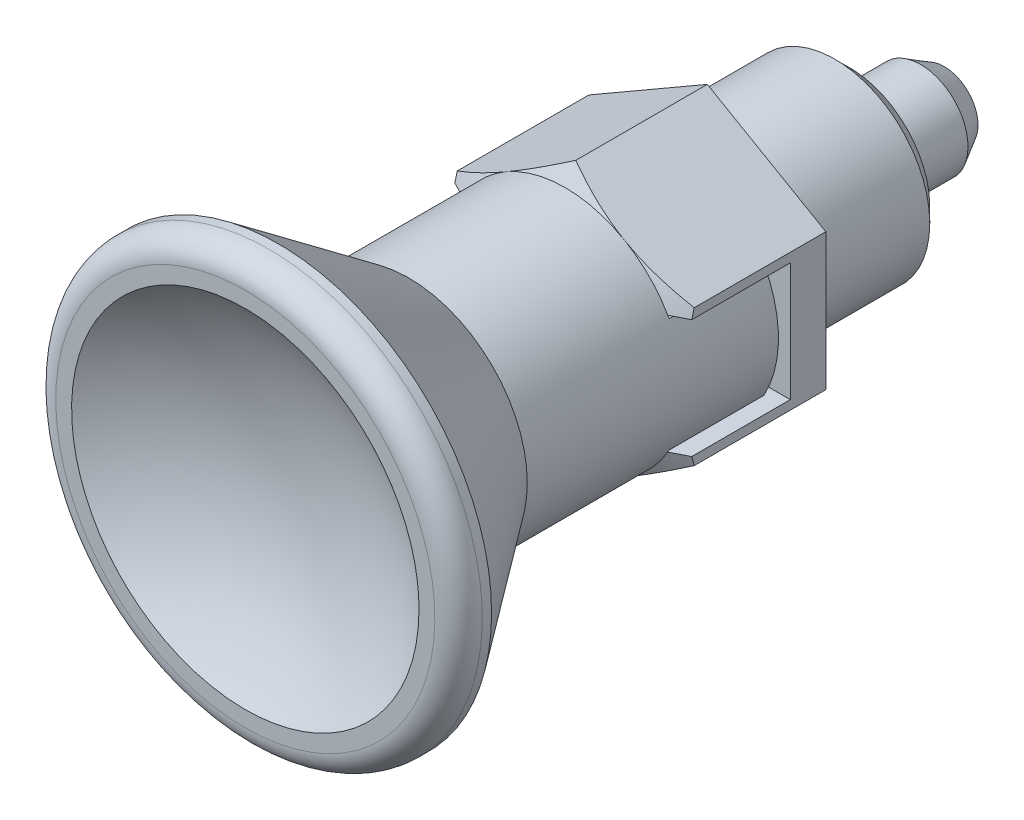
ISO-10303-21;
HEADER;
FILE_DESCRIPTION(('STEP AP214'),'2;1');
FILE_NAME('part.step','',(''),(''),'','','');
FILE_SCHEMA(('AUTOMOTIVE_DESIGN { 1 0 10303 214 1 1 1 1 }'));
ENDSEC;
DATA;
#1=APPLICATION_CONTEXT('core data for automotive mechanical design processes');
#2=APPLICATION_PROTOCOL_DEFINITION('international standard','automotive_design',2000,#1);
#3=PRODUCT_CONTEXT('',#1,'mechanical');
#4=PRODUCT('Part','Part','',(#3));
#5=PRODUCT_RELATED_PRODUCT_CATEGORY('part','',(#4));
#6=PRODUCT_DEFINITION_FORMATION('','',#4);
#7=PRODUCT_DEFINITION_CONTEXT('part definition',#1,'design');
#8=PRODUCT_DEFINITION('design','',#6,#7);
#9=PRODUCT_DEFINITION_SHAPE('','',#8);
#10=(LENGTH_UNIT() NAMED_UNIT(*) SI_UNIT(.MILLI.,.METRE.));
#11=(NAMED_UNIT(*) PLANE_ANGLE_UNIT() SI_UNIT($,.RADIAN.));
#12=(NAMED_UNIT(*) SI_UNIT($,.STERADIAN.) SOLID_ANGLE_UNIT());
#13=UNCERTAINTY_MEASURE_WITH_UNIT(LENGTH_MEASURE(1.E-05),#10,'distance_accuracy_value','');
#14=(GEOMETRIC_REPRESENTATION_CONTEXT(3) GLOBAL_UNCERTAINTY_ASSIGNED_CONTEXT((#13)) GLOBAL_UNIT_ASSIGNED_CONTEXT((#10,
#11,#12)) REPRESENTATION_CONTEXT('',''));
#15=CARTESIAN_POINT('',(0.,0.,0.));
#16=DIRECTION('',(0.,0.,1.));
#17=DIRECTION('',(1.,0.,0.));
#18=AXIS2_PLACEMENT_3D('',#15,#16,#17);
#19=CARTESIAN_POINT('',(1.42264973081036,-1.43972574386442,-10.));
#20=DIRECTION('',(0.,0.,-1.));
#21=DIRECTION('',(-1.,0.,0.));
#22=AXIS2_PLACEMENT_3D('',#19,#20,#21);
#23=PLANE('',#22);
#24=CARTESIAN_POINT('',(0.,0.,-10.));
#25=DIRECTION('',(0.,0.,1.));
#26=DIRECTION('',(0.,-1.,0.));
#27=AXIS2_PLACEMENT_3D('',#24,#25,#26);
#28=CIRCLE('',#27,1.42264973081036);
#29=CARTESIAN_POINT('',(0.,-1.42264973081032,-10.));
#30=VERTEX_POINT('',#29);
#31=EDGE_CURVE('E17',#30,#30,#28,.T.);
#32=ORIENTED_EDGE('',*,*,#31,.F.);
#33=EDGE_LOOP('',(#32));
#34=FACE_BOUND('',#33,.T.);
#35=ADVANCED_FACE('F14',(#34),#23,.T.);
#36=CARTESIAN_POINT('',(0.,0.,-10.));
#37=DIRECTION('',(0.,0.,1.));
#38=DIRECTION('',(0.,-1.,0.));
#39=AXIS2_PLACEMENT_3D('',#36,#37,#38);
#40=CONICAL_SURFACE('',#39,1.42264973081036,0.523598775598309);
#41=ORIENTED_EDGE('',*,*,#31,.T.);
#42=EDGE_LOOP('',(#41));
#43=FACE_BOUND('',#42,.T.);
#44=CARTESIAN_POINT('',(0.,0.,-9.));
#45=DIRECTION('',(0.,0.,1.));
#46=DIRECTION('',(1.,0.,0.));
#47=AXIS2_PLACEMENT_3D('',#44,#45,#46);
#48=CIRCLE('',#47,2.);
#49=CARTESIAN_POINT('',(2.,0.,-9.));
#50=VERTEX_POINT('',#49);
#51=EDGE_CURVE('E200',#50,#50,#48,.T.);
#52=ORIENTED_EDGE('',*,*,#51,.F.);
#53=EDGE_LOOP('',(#52));
#54=FACE_BOUND('',#53,.T.);
#55=ADVANCED_FACE('F542',(#43,#54),#40,.T.);
#56=CARTESIAN_POINT('',(0.,0.,-6.));
#57=DIRECTION('',(0.,0.,1.));
#58=DIRECTION('',(0.,-1.,0.));
#59=AXIS2_PLACEMENT_3D('',#56,#57,#58);
#60=CYLINDRICAL_SURFACE('',#59,2.);
#61=ORIENTED_EDGE('',*,*,#51,.T.);
#62=EDGE_LOOP('',(#61));
#63=FACE_BOUND('',#62,.T.);
#64=CARTESIAN_POINT('',(0.,0.,-6.));
#65=DIRECTION('',(0.,0.,1.));
#66=DIRECTION('',(0.,-1.,0.));
#67=AXIS2_PLACEMENT_3D('',#64,#65,#66);
#68=CIRCLE('',#67,2.);
#69=CARTESIAN_POINT('',(0.,-1.99999999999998,-6.00000000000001));
#70=VERTEX_POINT('',#69);
#71=EDGE_CURVE('E202',#70,#70,#68,.T.);
#72=ORIENTED_EDGE('',*,*,#71,.F.);
#73=EDGE_LOOP('',(#72));
#74=FACE_BOUND('',#73,.T.);
#75=ADVANCED_FACE('F539',(#63,#74),#60,.T.);
#76=CARTESIAN_POINT('',(3.3865,-3.42714010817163,-6.));
#77=DIRECTION('',(0.,0.,-1.));
#78=DIRECTION('',(-1.,0.,0.));
#79=AXIS2_PLACEMENT_3D('',#76,#77,#78);
#80=PLANE('',#79);
#81=ORIENTED_EDGE('',*,*,#71,.T.);
#82=EDGE_LOOP('',(#81));
#83=FACE_BOUND('',#82,.T.);
#84=CARTESIAN_POINT('',(0.,0.,-6.));
#85=DIRECTION('',(0.,0.,1.));
#86=DIRECTION('',(0.,-1.,0.));
#87=AXIS2_PLACEMENT_3D('',#84,#85,#86);
#88=CIRCLE('',#87,3.3865);
#89=CARTESIAN_POINT('',(0.,-3.38649999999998,-6.00000000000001));
#90=VERTEX_POINT('',#89);
#91=EDGE_CURVE('E199',#90,#90,#88,.T.);
#92=ORIENTED_EDGE('',*,*,#91,.F.);
#93=EDGE_LOOP('',(#92));
#94=FACE_BOUND('',#93,.T.);
#95=ADVANCED_FACE('F535',(#83,#94),#80,.T.);
#96=CARTESIAN_POINT('',(0.,0.,-6.));
#97=DIRECTION('',(0.,0.,1.));
#98=DIRECTION('',(0.,-1.,0.));
#99=AXIS2_PLACEMENT_3D('',#96,#97,#98);
#100=CONICAL_SURFACE('',#99,3.3865,0.78539816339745);
#101=CARTESIAN_POINT('',(0.,0.,-5.3865));
#102=DIRECTION('',(0.,0.,1.));
#103=DIRECTION('',(1.,0.,0.));
#104=AXIS2_PLACEMENT_3D('',#101,#102,#103);
#105=CIRCLE('',#104,4.);
#106=CARTESIAN_POINT('',(4.00000000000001,0.,-5.3865));
#107=VERTEX_POINT('',#106);
#108=EDGE_CURVE('E160',#107,#107,#105,.T.);
#109=ORIENTED_EDGE('',*,*,#108,.F.);
#110=EDGE_LOOP('',(#109));
#111=FACE_BOUND('',#110,.T.);
#112=ORIENTED_EDGE('',*,*,#91,.T.);
#113=EDGE_LOOP('',(#112));
#114=FACE_BOUND('',#113,.T.);
#115=ADVANCED_FACE('F531',(#111,#114),#100,.T.);
#116=CARTESIAN_POINT('',(0.,0.,0.));
#117=DIRECTION('',(0.,0.,1.));
#118=DIRECTION('',(0.,-1.,0.));
#119=AXIS2_PLACEMENT_3D('',#116,#117,#118);
#120=CYLINDRICAL_SURFACE('',#119,4.);
#121=CARTESIAN_POINT('',(0.,0.,0.));
#122=DIRECTION('',(0.,0.,1.));
#123=DIRECTION('',(0.,-1.,0.));
#124=AXIS2_PLACEMENT_3D('',#121,#122,#123);
#125=CIRCLE('',#124,4.);
#126=CARTESIAN_POINT('',(0.,-4.,0.));
#127=VERTEX_POINT('',#126);
#128=EDGE_CURVE('E509',#127,#127,#125,.T.);
#129=ORIENTED_EDGE('',*,*,#128,.F.);
#130=EDGE_LOOP('',(#129));
#131=FACE_BOUND('',#130,.T.);
#132=ORIENTED_EDGE('',*,*,#108,.T.);
#133=EDGE_LOOP('',(#132));
#134=FACE_BOUND('',#133,.T.);
#135=ADVANCED_FACE('F528',(#131,#134),#120,.T.);
#136=CARTESIAN_POINT('',(2.8,-2.5,1.5));
#137=DIRECTION('',(0.,1.,0.));
#138=DIRECTION('',(0.,0.,1.));
#139=AXIS2_PLACEMENT_3D('',#136,#137,#138);
#140=PLANE('',#139);
#141=DIRECTION('',(0.,0.,1.));
#142=VECTOR('',#141,1.);
#143=CARTESIAN_POINT('',(2.8,-2.5,1.5));
#144=LINE('',#143,#142);
#145=CARTESIAN_POINT('',(2.8,-2.5,6.));
#146=VERTEX_POINT('',#145);
#147=CARTESIAN_POINT('',(2.8,-2.5,1.5));
#148=VERTEX_POINT('',#147);
#149=EDGE_CURVE('E714',#146,#148,#144,.F.);
#150=ORIENTED_EDGE('',*,*,#149,.F.);
#151=DIRECTION('',(1.,0.,0.));
#152=VECTOR('',#151,1.);
#153=CARTESIAN_POINT('',(2.8,-2.5,6.));
#154=LINE('',#153,#152);
#155=CARTESIAN_POINT('',(4.3301270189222,-2.5,6.));
#156=VERTEX_POINT('',#155);
#157=EDGE_CURVE('E157',#156,#146,#154,.F.);
#158=ORIENTED_EDGE('',*,*,#157,.F.);
#159=CARTESIAN_POINT('',(4.3301270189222,-2.5,6.));
#160=CARTESIAN_POINT('',(4.38614497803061,-2.50000000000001,5.97199057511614));
#161=CARTESIAN_POINT('',(4.44210887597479,-2.50000000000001,5.94387319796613));
#162=CARTESIAN_POINT('',(4.55393611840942,-2.50000000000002,5.88744062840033));
#163=CARTESIAN_POINT('',(4.60979946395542,-2.50000000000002,5.85912543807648));
#164=CARTESIAN_POINT('',(4.72143426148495,-2.50000000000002,5.80231478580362));
#165=CARTESIAN_POINT('',(4.77720571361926,-2.50000000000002,5.77381932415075));
#166=CARTESIAN_POINT('',(4.88866440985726,-2.50000000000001,5.71666272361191));
#167=CARTESIAN_POINT('',(4.94435165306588,-2.50000000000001,5.68800158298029));
#168=CARTESIAN_POINT('',(5.,-2.5,5.6592652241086));
#169=B_SPLINE_CURVE_WITH_KNOTS('',3,(#159,#160,#161,#162,#163,#164,#165,#166,#167,#168),
.UNSPECIFIED.,.F.,.F.,(4,2,2,2,4),(0.,0.187890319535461,0.375778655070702,0.563666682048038,
0.751556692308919),.UNSPECIFIED.);
#170=CARTESIAN_POINT('',(5.,-2.5,5.6592652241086));
#171=VERTEX_POINT('',#170);
#172=EDGE_CURVE('E125',#156,#171,#169,.T.);
#173=ORIENTED_EDGE('',*,*,#172,.T.);
#174=DIRECTION('',(0.,0.,-1.));
#175=VECTOR('',#174,1.);
#176=CARTESIAN_POINT('',(5.,-2.5,5.6592652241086));
#177=LINE('',#176,#175);
#178=CARTESIAN_POINT('',(5.,-2.5,1.5));
#179=VERTEX_POINT('',#178);
#180=EDGE_CURVE('E152',#179,#171,#177,.F.);
#181=ORIENTED_EDGE('',*,*,#180,.F.);
#182=DIRECTION('',(1.,0.,0.));
#183=VECTOR('',#182,1.);
#184=CARTESIAN_POINT('',(2.8,-2.5,1.5));
#185=LINE('',#184,#183);
#186=EDGE_CURVE('E159',#148,#179,#185,.T.);
#187=ORIENTED_EDGE('',*,*,#186,.F.);
#188=EDGE_LOOP('',(#150,#158,#173,#181,#187));
#189=FACE_BOUND('',#188,.T.);
#190=ADVANCED_FACE('F155',(#189),#140,.T.);
#191=CARTESIAN_POINT('',(2.8,2.5,1.5));
#192=DIRECTION('',(0.,0.,1.));
#193=DIRECTION('',(0.,-1.,0.));
#194=AXIS2_PLACEMENT_3D('',#191,#192,#193);
#195=PLANE('',#194);
#196=DIRECTION('',(0.,1.,0.));
#197=VECTOR('',#196,1.);
#198=CARTESIAN_POINT('',(2.8,0.,1.5));
#199=LINE('',#198,#197);
#200=CARTESIAN_POINT('',(2.8,2.5,1.5));
#201=VERTEX_POINT('',#200);
#202=EDGE_CURVE('E191',#148,#201,#199,.T.);
#203=ORIENTED_EDGE('',*,*,#202,.F.);
#204=ORIENTED_EDGE('',*,*,#186,.T.);
#205=DIRECTION('',(0.,-1.,0.));
#206=VECTOR('',#205,1.);
#207=CARTESIAN_POINT('',(5.,0.,1.5));
#208=LINE('',#207,#206);
#209=CARTESIAN_POINT('',(5.,2.5,1.5));
#210=VERTEX_POINT('',#209);
#211=EDGE_CURVE('E174',#210,#179,#208,.T.);
#212=ORIENTED_EDGE('',*,*,#211,.F.);
#213=DIRECTION('',(1.,0.,0.));
#214=VECTOR('',#213,1.);
#215=CARTESIAN_POINT('',(2.8,2.5,1.5));
#216=LINE('',#215,#214);
#217=EDGE_CURVE('E175',#201,#210,#216,.T.);
#218=ORIENTED_EDGE('',*,*,#217,.F.);
#219=EDGE_LOOP('',(#203,#204,#212,#218));
#220=FACE_BOUND('',#219,.T.);
#221=ADVANCED_FACE('F521',(#220),#195,.T.);
#222=CARTESIAN_POINT('',(2.8,2.5,6.));
#223=DIRECTION('',(0.,-1.,0.));
#224=DIRECTION('',(0.,0.,-1.));
#225=AXIS2_PLACEMENT_3D('',#222,#223,#224);
#226=PLANE('',#225);
#227=ORIENTED_EDGE('',*,*,#217,.T.);
#228=DIRECTION('',(0.,0.,-1.));
#229=VECTOR('',#228,1.);
#230=CARTESIAN_POINT('',(5.,2.5,5.65926522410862));
#231=LINE('',#230,#229);
#232=CARTESIAN_POINT('',(5.,2.5,5.65926522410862));
#233=VERTEX_POINT('',#232);
#234=EDGE_CURVE('E182',#233,#210,#231,.T.);
#235=ORIENTED_EDGE('',*,*,#234,.F.);
#236=CARTESIAN_POINT('',(5.,2.5,5.65926522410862));
#237=CARTESIAN_POINT('',(4.94435165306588,2.5,5.6880015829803));
#238=CARTESIAN_POINT('',(4.88866440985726,2.5,5.71666272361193));
#239=CARTESIAN_POINT('',(4.77720571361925,2.5,5.77381932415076));
#240=CARTESIAN_POINT('',(4.72143426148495,2.5,5.80231478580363));
#241=CARTESIAN_POINT('',(4.60979946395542,2.5,5.85912543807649));
#242=CARTESIAN_POINT('',(4.55393611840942,2.5,5.88744062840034));
#243=CARTESIAN_POINT('',(4.44210887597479,2.5,5.94387319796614));
#244=CARTESIAN_POINT('',(4.38614497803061,2.5,5.97199057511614));
#245=CARTESIAN_POINT('',(4.3301270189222,2.5,6.));
#246=B_SPLINE_CURVE_WITH_KNOTS('',3,(#236,#237,#238,#239,#240,#241,#242,#243,#244,#245),
.UNSPECIFIED.,.F.,.F.,(4,2,2,2,4),(0.,0.187890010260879,0.375778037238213,0.563666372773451,
0.75155669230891),.UNSPECIFIED.);
#247=CARTESIAN_POINT('',(4.3301270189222,2.5,6.));
#248=VERTEX_POINT('',#247);
#249=EDGE_CURVE('E186',#233,#248,#246,.T.);
#250=ORIENTED_EDGE('',*,*,#249,.T.);
#251=DIRECTION('',(1.,0.,0.));
#252=VECTOR('',#251,1.);
#253=CARTESIAN_POINT('',(2.8,2.5,6.));
#254=LINE('',#253,#252);
#255=CARTESIAN_POINT('',(2.8,2.5,6.));
#256=VERTEX_POINT('',#255);
#257=EDGE_CURVE('E178',#248,#256,#254,.F.);
#258=ORIENTED_EDGE('',*,*,#257,.T.);
#259=DIRECTION('',(0.,0.,1.));
#260=VECTOR('',#259,1.);
#261=CARTESIAN_POINT('',(2.8,2.5,1.5));
#262=LINE('',#261,#260);
#263=EDGE_CURVE('E187',#201,#256,#262,.T.);
#264=ORIENTED_EDGE('',*,*,#263,.F.);
#265=EDGE_LOOP('',(#227,#235,#250,#258,#264));
#266=FACE_BOUND('',#265,.T.);
#267=ADVANCED_FACE('F516',(#266),#226,.T.);
#268=CARTESIAN_POINT('',(5.,2.88675134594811,5.69322081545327));
#269=DIRECTION('',(1.,0.,0.));
#270=DIRECTION('',(0.,-1.,0.));
#271=AXIS2_PLACEMENT_3D('',#268,#269,#270);
#272=PLANE('',#271);
#273=ORIENTED_EDGE('',*,*,#234,.T.);
#274=ORIENTED_EDGE('',*,*,#211,.T.);
#275=ORIENTED_EDGE('',*,*,#180,.T.);
#276=CARTESIAN_POINT('',(5.,-2.50000000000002,5.6592652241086));
#277=CARTESIAN_POINT('',(5.,-2.51589484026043,5.65516106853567));
#278=CARTESIAN_POINT('',(5.,-2.53178209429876,5.65102754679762));
#279=CARTESIAN_POINT('',(5.,-2.56362164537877,5.64268167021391));
#280=CARTESIAN_POINT('',(5.,-2.57957386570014,5.63846902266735));
#281=CARTESIAN_POINT('',(5.,-2.61154334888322,5.62996489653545));
#282=CARTESIAN_POINT('',(5.,-2.62756053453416,5.62567312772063));
#283=CARTESIAN_POINT('',(5.,-2.65965994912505,5.61701075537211));
#284=CARTESIAN_POINT('',(5.,-2.67574210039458,5.61263986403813));
#285=CARTESIAN_POINT('',(5.,-2.7079714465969,5.60381924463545));
#286=CARTESIAN_POINT('',(5.,-2.7241185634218,5.59936923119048));
#287=CARTESIAN_POINT('',(5.,-2.75647784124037,5.59039036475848));
#288=CARTESIAN_POINT('',(5.,-2.7726899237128,5.58586122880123));
#289=CARTESIAN_POINT('',(5.,-2.80517913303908,5.57672411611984));
#290=CARTESIAN_POINT('',(5.,-2.8214561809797,5.57211585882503));
#291=CARTESIAN_POINT('',(5.,-2.8540753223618,5.56282049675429));
#292=CARTESIAN_POINT('',(5.,-2.87041733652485,5.55813311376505));
#293=CARTESIAN_POINT('',(5.,-2.88675134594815,5.55341801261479));
#294=B_SPLINE_CURVE_WITH_KNOTS('',3,(#276,#277,#278,#279,#280,#281,#282,#283,#284,#285,#286,
#287,#288,#289,#290,#291,#292,#293),.UNSPECIFIED.,.F.,.F.,(4,2,2,2,2,2,2,2,4),(0.,
0.0492484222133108,0.0987455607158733,0.148492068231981,0.198488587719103,0.248735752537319,
0.299234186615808,0.349984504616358,0.400987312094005),.UNSPECIFIED.);
#295=CARTESIAN_POINT('',(5.,-2.88675134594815,5.55341801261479));
#296=VERTEX_POINT('',#295);
#297=EDGE_CURVE('E163',#171,#296,#294,.T.);
#298=ORIENTED_EDGE('',*,*,#297,.T.);
#299=DIRECTION('',(0.,0.,-1.));
#300=VECTOR('',#299,1.);
#301=CARTESIAN_POINT('',(5.,-2.88675134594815,6.));
#302=LINE('',#301,#300);
#303=CARTESIAN_POINT('',(5.,-2.88675134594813,0.));
#304=VERTEX_POINT('',#303);
#305=EDGE_CURVE('E322',#304,#296,#302,.F.);
#306=ORIENTED_EDGE('',*,*,#305,.F.);
#307=DIRECTION('',(0.,1.,0.));
#308=VECTOR('',#307,1.);
#309=CARTESIAN_POINT('',(5.,-5.77350269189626,0.));
#310=LINE('',#309,#308);
#311=CARTESIAN_POINT('',(5.,2.88675134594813,0.));
#312=VERTEX_POINT('',#311);
#313=EDGE_CURVE('E136',#312,#304,#310,.F.);
#314=ORIENTED_EDGE('',*,*,#313,.F.);
#315=DIRECTION('',(0.,0.,-1.));
#316=VECTOR('',#315,1.);
#317=CARTESIAN_POINT('',(5.,2.88675134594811,6.));
#318=LINE('',#317,#316);
#319=CARTESIAN_POINT('',(5.,2.88675134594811,5.55341801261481));
#320=VERTEX_POINT('',#319);
#321=EDGE_CURVE('E306',#320,#312,#318,.T.);
#322=ORIENTED_EDGE('',*,*,#321,.F.);
#323=CARTESIAN_POINT('',(5.,2.88675134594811,5.55341801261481));
#324=CARTESIAN_POINT('',(5.,2.87041733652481,5.55813311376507));
#325=CARTESIAN_POINT('',(5.,2.85407532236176,5.5628204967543));
#326=CARTESIAN_POINT('',(5.,2.82145618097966,5.57211585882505));
#327=CARTESIAN_POINT('',(5.,2.80517913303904,5.57672411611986));
#328=CARTESIAN_POINT('',(5.,2.77268992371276,5.58586122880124));
#329=CARTESIAN_POINT('',(5.,2.75647784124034,5.5903903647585));
#330=CARTESIAN_POINT('',(5.,2.72411856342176,5.5993692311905));
#331=CARTESIAN_POINT('',(5.,2.70797144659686,5.60381924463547));
#332=CARTESIAN_POINT('',(5.,2.67574210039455,5.61263986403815));
#333=CARTESIAN_POINT('',(5.,2.65965994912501,5.61701075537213));
#334=CARTESIAN_POINT('',(5.,2.62756053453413,5.62567312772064));
#335=CARTESIAN_POINT('',(5.,2.61154334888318,5.62996489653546));
#336=CARTESIAN_POINT('',(5.,2.5795738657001,5.63846902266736));
#337=CARTESIAN_POINT('',(5.,2.56362164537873,5.64268167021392));
#338=CARTESIAN_POINT('',(5.,2.53178209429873,5.65102754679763));
#339=CARTESIAN_POINT('',(5.,2.5158948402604,5.65516106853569));
#340=CARTESIAN_POINT('',(5.,2.49999999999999,5.65926522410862));
#341=B_SPLINE_CURVE_WITH_KNOTS('',3,(#323,#324,#325,#326,#327,#328,#329,#330,#331,#332,#333,
#334,#335,#336,#337,#338,#339,#340),.UNSPECIFIED.,.F.,.F.,(4,2,2,2,2,2,2,2,4),(0.,
0.0510028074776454,0.101753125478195,0.152251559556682,0.202498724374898,0.252495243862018,
0.302241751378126,0.351738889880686,0.400987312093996),.UNSPECIFIED.);
#342=EDGE_CURVE('E168',#320,#233,#341,.T.);
#343=ORIENTED_EDGE('',*,*,#342,.T.);
#344=EDGE_LOOP('',(#273,#274,#275,#298,#306,#314,#322,#343));
#345=FACE_BOUND('',#344,.T.);
#346=ADVANCED_FACE('F172',(#345),#272,.T.);
#347=CARTESIAN_POINT('',(5.,-5.84278472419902,0.));
#348=DIRECTION('',(0.,0.,-1.));
#349=DIRECTION('',(-1.,0.,0.));
#350=AXIS2_PLACEMENT_3D('',#347,#348,#349);
#351=PLANE('',#350);
#352=ORIENTED_EDGE('',*,*,#128,.T.);
#353=EDGE_LOOP('',(#352));
#354=FACE_BOUND('',#353,.T.);
#355=DIRECTION('',(0.,-1.,0.));
#356=VECTOR('',#355,1.);
#357=CARTESIAN_POINT('',(-5.,0.,0.));
#358=LINE('',#357,#356);
#359=CARTESIAN_POINT('',(-5.,2.88675134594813,0.));
#360=VERTEX_POINT('',#359);
#361=CARTESIAN_POINT('',(-5.,-2.88675134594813,0.));
#362=VERTEX_POINT('',#361);
#363=EDGE_CURVE('E388',#360,#362,#358,.T.);
#364=ORIENTED_EDGE('',*,*,#363,.F.);
#365=DIRECTION('',(-0.866025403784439,-0.5,0.));
#366=VECTOR('',#365,1.);
#367=CARTESIAN_POINT('',(-2.5,4.3301270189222,0.));
#368=LINE('',#367,#366);
#369=CARTESIAN_POINT('',(0.,5.77350269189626,0.));
#370=VERTEX_POINT('',#369);
#371=EDGE_CURVE('E300',#370,#360,#368,.T.);
#372=ORIENTED_EDGE('',*,*,#371,.F.);
#373=DIRECTION('',(-0.866025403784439,0.5,0.));
#374=VECTOR('',#373,1.);
#375=CARTESIAN_POINT('',(2.5,4.3301270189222,0.));
#376=LINE('',#375,#374);
#377=EDGE_CURVE('E195',#312,#370,#376,.T.);
#378=ORIENTED_EDGE('',*,*,#377,.F.);
#379=ORIENTED_EDGE('',*,*,#313,.T.);
#380=DIRECTION('',(0.866025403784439,0.5,0.));
#381=VECTOR('',#380,1.);
#382=CARTESIAN_POINT('',(2.5,-4.3301270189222,0.));
#383=LINE('',#382,#381);
#384=CARTESIAN_POINT('',(0.,-5.77350269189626,0.));
#385=VERTEX_POINT('',#384);
#386=EDGE_CURVE('E325',#385,#304,#383,.T.);
#387=ORIENTED_EDGE('',*,*,#386,.F.);
#388=DIRECTION('',(0.866025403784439,-0.5,0.));
#389=VECTOR('',#388,1.);
#390=CARTESIAN_POINT('',(-2.5,-4.3301270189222,0.));
#391=LINE('',#390,#389);
#392=EDGE_CURVE('E334',#362,#385,#391,.T.);
#393=ORIENTED_EDGE('',*,*,#392,.F.);
#394=EDGE_LOOP('',(#364,#372,#378,#379,#387,#393));
#395=FACE_BOUND('',#394,.T.);
#396=ADVANCED_FACE('F636',(#354,#395),#351,.T.);
#397=CARTESIAN_POINT('',(-5.,-2.88675134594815,5.69322081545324));
#398=DIRECTION('',(-1.,0.,0.));
#399=DIRECTION('',(0.,1.,0.));
#400=AXIS2_PLACEMENT_3D('',#397,#398,#399);
#401=PLANE('',#400);
#402=CARTESIAN_POINT('',(-5.,-2.88675134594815,5.55341801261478));
#403=CARTESIAN_POINT('',(-5.,-2.87041733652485,5.55813311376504));
#404=CARTESIAN_POINT('',(-5.,-2.8540753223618,5.56282049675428));
#405=CARTESIAN_POINT('',(-5.,-2.8214561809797,5.57211585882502));
#406=CARTESIAN_POINT('',(-5.,-2.80517913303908,5.57672411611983));
#407=CARTESIAN_POINT('',(-5.,-2.7726899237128,5.58586122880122));
#408=CARTESIAN_POINT('',(-5.,-2.75647784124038,5.59039036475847));
#409=CARTESIAN_POINT('',(-5.,-2.7241185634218,5.59936923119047));
#410=CARTESIAN_POINT('',(-5.,-2.7079714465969,5.60381924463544));
#411=CARTESIAN_POINT('',(-5.,-2.67574210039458,5.61263986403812));
#412=CARTESIAN_POINT('',(-5.,-2.65965994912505,5.6170107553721));
#413=CARTESIAN_POINT('',(-5.,-2.62756053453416,5.62567312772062));
#414=CARTESIAN_POINT('',(-5.,-2.61154334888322,5.62996489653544));
#415=CARTESIAN_POINT('',(-5.,-2.57957386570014,5.63846902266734));
#416=CARTESIAN_POINT('',(-5.,-2.56362164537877,5.6426816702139));
#417=CARTESIAN_POINT('',(-5.,-2.53178209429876,5.65102754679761));
#418=CARTESIAN_POINT('',(-5.,-2.51589484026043,5.65516106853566));
#419=CARTESIAN_POINT('',(-5.,-2.50000000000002,5.65926522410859));
#420=B_SPLINE_CURVE_WITH_KNOTS('',3,(#402,#403,#404,#405,#406,#407,#408,#409,#410,#411,#412,
#413,#414,#415,#416,#417,#418,#419),.UNSPECIFIED.,.F.,.F.,(4,2,2,2,2,2,2,2,4),(0.,
0.051002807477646,0.101753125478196,0.152251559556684,0.2024987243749,0.252495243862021,
0.30224175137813,0.351738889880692,0.400987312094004),.UNSPECIFIED.);
#421=CARTESIAN_POINT('',(-5.,-2.88675134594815,5.55341801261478));
#422=VERTEX_POINT('',#421);
#423=CARTESIAN_POINT('',(-5.,-2.5,5.65926522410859));
#424=VERTEX_POINT('',#423);
#425=EDGE_CURVE('E384',#422,#424,#420,.T.);
#426=ORIENTED_EDGE('',*,*,#425,.T.);
#427=DIRECTION('',(0.,0.,1.));
#428=VECTOR('',#427,1.);
#429=CARTESIAN_POINT('',(-5.,-2.5,3.75));
#430=LINE('',#429,#428);
#431=CARTESIAN_POINT('',(-5.,-2.5,1.5));
#432=VERTEX_POINT('',#431);
#433=EDGE_CURVE('E387',#432,#424,#430,.T.);
#434=ORIENTED_EDGE('',*,*,#433,.F.);
#435=DIRECTION('',(0.,-1.,0.));
#436=VECTOR('',#435,1.);
#437=CARTESIAN_POINT('',(-5.,0.,1.5));
#438=LINE('',#437,#436);
#439=CARTESIAN_POINT('',(-5.,2.5,1.5));
#440=VERTEX_POINT('',#439);
#441=EDGE_CURVE('E356',#440,#432,#438,.T.);
#442=ORIENTED_EDGE('',*,*,#441,.F.);
#443=DIRECTION('',(0.,0.,-1.));
#444=VECTOR('',#443,1.);
#445=CARTESIAN_POINT('',(-5.,2.5,3.75));
#446=LINE('',#445,#444);
#447=CARTESIAN_POINT('',(-5.,2.5,5.65926522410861));
#448=VERTEX_POINT('',#447);
#449=EDGE_CURVE('E403',#448,#440,#446,.T.);
#450=ORIENTED_EDGE('',*,*,#449,.F.);
#451=CARTESIAN_POINT('',(-5.,2.49999999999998,5.65926522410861));
#452=CARTESIAN_POINT('',(-5.,2.51589484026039,5.65516106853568));
#453=CARTESIAN_POINT('',(-5.,2.53178209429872,5.65102754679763));
#454=CARTESIAN_POINT('',(-5.,2.56362164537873,5.64268167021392));
#455=CARTESIAN_POINT('',(-5.,2.5795738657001,5.63846902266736));
#456=CARTESIAN_POINT('',(-5.,2.61154334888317,5.62996489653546));
#457=CARTESIAN_POINT('',(-5.,2.62756053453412,5.62567312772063));
#458=CARTESIAN_POINT('',(-5.,2.659659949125,5.61701075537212));
#459=CARTESIAN_POINT('',(-5.,2.67574210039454,5.61263986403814));
#460=CARTESIAN_POINT('',(-5.,2.70797144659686,5.60381924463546));
#461=CARTESIAN_POINT('',(-5.,2.72411856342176,5.59936923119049));
#462=CARTESIAN_POINT('',(-5.,2.75647784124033,5.59039036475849));
#463=CARTESIAN_POINT('',(-5.,2.77268992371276,5.58586122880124));
#464=CARTESIAN_POINT('',(-5.,2.80517913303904,5.57672411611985));
#465=CARTESIAN_POINT('',(-5.,2.82145618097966,5.57211585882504));
#466=CARTESIAN_POINT('',(-5.,2.85407532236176,5.5628204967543));
#467=CARTESIAN_POINT('',(-5.,2.87041733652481,5.55813311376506));
#468=CARTESIAN_POINT('',(-5.,2.88675134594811,5.5534180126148));
#469=B_SPLINE_CURVE_WITH_KNOTS('',3,(#451,#452,#453,#454,#455,#456,#457,#458,#459,#460,#461,
#462,#463,#464,#465,#466,#467,#468),.UNSPECIFIED.,.F.,.F.,(4,2,2,2,2,2,2,2,4),(0.,
0.0492484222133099,0.0987455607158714,0.148492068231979,0.1984885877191,0.248735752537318,
0.299234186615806,0.349984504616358,0.400987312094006),.UNSPECIFIED.);
#470=CARTESIAN_POINT('',(-5.,2.88675134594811,5.5534180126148));
#471=VERTEX_POINT('',#470);
#472=EDGE_CURVE('E367',#448,#471,#469,.T.);
#473=ORIENTED_EDGE('',*,*,#472,.T.);
#474=DIRECTION('',(0.,0.,-1.));
#475=VECTOR('',#474,1.);
#476=CARTESIAN_POINT('',(-5.,2.88675134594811,6.));
#477=LINE('',#476,#475);
#478=EDGE_CURVE('E296',#360,#471,#477,.F.);
#479=ORIENTED_EDGE('',*,*,#478,.F.);
#480=ORIENTED_EDGE('',*,*,#363,.T.);
#481=DIRECTION('',(0.,0.,-1.));
#482=VECTOR('',#481,1.);
#483=CARTESIAN_POINT('',(-5.,-2.88675134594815,6.));
#484=LINE('',#483,#482);
#485=EDGE_CURVE('E331',#422,#362,#484,.T.);
#486=ORIENTED_EDGE('',*,*,#485,.F.);
#487=EDGE_LOOP('',(#426,#434,#442,#450,#473,#479,#480,#486));
#488=FACE_BOUND('',#487,.T.);
#489=ADVANCED_FACE('F380',(#488),#401,.T.);
#490=CARTESIAN_POINT('',(-2.8,-2.5,6.));
#491=DIRECTION('',(0.,1.,0.));
#492=DIRECTION('',(0.,0.,-1.));
#493=AXIS2_PLACEMENT_3D('',#490,#491,#492);
#494=PLANE('',#493);
#495=DIRECTION('',(0.,0.,1.));
#496=VECTOR('',#495,1.);
#497=CARTESIAN_POINT('',(-2.8,-2.5,1.5));
#498=LINE('',#497,#496);
#499=CARTESIAN_POINT('',(-2.8,-2.5,1.5));
#500=VERTEX_POINT('',#499);
#501=CARTESIAN_POINT('',(-2.8,-2.5,6.));
#502=VERTEX_POINT('',#501);
#503=EDGE_CURVE('E337',#500,#502,#498,.T.);
#504=ORIENTED_EDGE('',*,*,#503,.F.);
#505=DIRECTION('',(1.,0.,0.));
#506=VECTOR('',#505,1.);
#507=CARTESIAN_POINT('',(-5.,-2.5,1.5));
#508=LINE('',#507,#506);
#509=EDGE_CURVE('E352',#432,#500,#508,.T.);
#510=ORIENTED_EDGE('',*,*,#509,.F.);
#511=ORIENTED_EDGE('',*,*,#433,.T.);
#512=CARTESIAN_POINT('',(-5.,-2.5,5.65926522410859));
#513=CARTESIAN_POINT('',(-4.94435165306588,-2.5,5.68800158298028));
#514=CARTESIAN_POINT('',(-4.88866440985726,-2.5,5.71666272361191));
#515=CARTESIAN_POINT('',(-4.77720571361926,-2.5,5.77381932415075));
#516=CARTESIAN_POINT('',(-4.72143426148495,-2.5,5.80231478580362));
#517=CARTESIAN_POINT('',(-4.60979946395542,-2.5,5.85912543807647));
#518=CARTESIAN_POINT('',(-4.55393611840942,-2.5,5.88744062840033));
#519=CARTESIAN_POINT('',(-4.44210887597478,-2.5,5.94387319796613));
#520=CARTESIAN_POINT('',(-4.38614497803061,-2.5,5.97199057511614));
#521=CARTESIAN_POINT('',(-4.33012701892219,-2.5,6.));
#522=B_SPLINE_CURVE_WITH_KNOTS('',3,(#512,#513,#514,#515,#516,#517,#518,#519,#520,#521),
.UNSPECIFIED.,.F.,.F.,(4,2,2,2,4),(0.,0.187890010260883,0.375778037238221,0.563666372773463,
0.751556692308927),.UNSPECIFIED.);
#523=CARTESIAN_POINT('',(-4.3301270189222,-2.5,6.));
#524=VERTEX_POINT('',#523);
#525=EDGE_CURVE('E399',#424,#524,#522,.T.);
#526=ORIENTED_EDGE('',*,*,#525,.T.);
#527=DIRECTION('',(-1.,0.,0.));
#528=VECTOR('',#527,1.);
#529=CARTESIAN_POINT('',(-2.8,-2.5,6.));
#530=LINE('',#529,#528);
#531=EDGE_CURVE('E346',#502,#524,#530,.T.);
#532=ORIENTED_EDGE('',*,*,#531,.F.);
#533=EDGE_LOOP('',(#504,#510,#511,#526,#532));
#534=FACE_BOUND('',#533,.T.);
#535=ADVANCED_FACE('F377',(#534),#494,.T.);
#536=CARTESIAN_POINT('',(-2.8,2.5,1.5));
#537=DIRECTION('',(0.,-1.,0.));
#538=DIRECTION('',(0.,0.,1.));
#539=AXIS2_PLACEMENT_3D('',#536,#537,#538);
#540=PLANE('',#539);
#541=DIRECTION('',(-1.,0.,0.));
#542=VECTOR('',#541,1.);
#543=CARTESIAN_POINT('',(-2.8,2.5,6.));
#544=LINE('',#543,#542);
#545=CARTESIAN_POINT('',(-4.3301270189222,2.5,6.));
#546=VERTEX_POINT('',#545);
#547=CARTESIAN_POINT('',(-2.8,2.5,6.));
#548=VERTEX_POINT('',#547);
#549=EDGE_CURVE('E341',#546,#548,#544,.F.);
#550=ORIENTED_EDGE('',*,*,#549,.F.);
#551=CARTESIAN_POINT('',(-4.33012701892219,2.5,6.));
#552=CARTESIAN_POINT('',(-4.38614497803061,2.49999999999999,5.97199057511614));
#553=CARTESIAN_POINT('',(-4.44210887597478,2.49999999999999,5.94387319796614));
#554=CARTESIAN_POINT('',(-4.55393611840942,2.49999999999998,5.88744062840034));
#555=CARTESIAN_POINT('',(-4.60979946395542,2.49999999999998,5.85912543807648));
#556=CARTESIAN_POINT('',(-4.72143426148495,2.49999999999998,5.80231478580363));
#557=CARTESIAN_POINT('',(-4.77720571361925,2.49999999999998,5.77381932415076));
#558=CARTESIAN_POINT('',(-4.88866440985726,2.49999999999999,5.71666272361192));
#559=CARTESIAN_POINT('',(-4.94435165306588,2.49999999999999,5.6880015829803));
#560=CARTESIAN_POINT('',(-5.,2.5,5.65926522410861));
#561=B_SPLINE_CURVE_WITH_KNOTS('',3,(#551,#552,#553,#554,#555,#556,#557,#558,#559,#560),
.UNSPECIFIED.,.F.,.F.,(4,2,2,2,4),(0.,0.187890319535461,0.375778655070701,0.563666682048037,
0.751556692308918),.UNSPECIFIED.);
#562=EDGE_CURVE('E402',#546,#448,#561,.T.);
#563=ORIENTED_EDGE('',*,*,#562,.T.);
#564=ORIENTED_EDGE('',*,*,#449,.T.);
#565=DIRECTION('',(1.,0.,0.));
#566=VECTOR('',#565,1.);
#567=CARTESIAN_POINT('',(-5.,2.5,1.5));
#568=LINE('',#567,#566);
#569=CARTESIAN_POINT('',(-2.8,2.5,1.5));
#570=VERTEX_POINT('',#569);
#571=EDGE_CURVE('E355',#570,#440,#568,.F.);
#572=ORIENTED_EDGE('',*,*,#571,.F.);
#573=DIRECTION('',(0.,0.,1.));
#574=VECTOR('',#573,1.);
#575=CARTESIAN_POINT('',(-2.8,2.5,1.5));
#576=LINE('',#575,#574);
#577=EDGE_CURVE('E289',#548,#570,#576,.F.);
#578=ORIENTED_EDGE('',*,*,#577,.F.);
#579=EDGE_LOOP('',(#550,#563,#564,#572,#578));
#580=FACE_BOUND('',#579,.T.);
#581=ADVANCED_FACE('F428',(#580),#540,.T.);
#582=CARTESIAN_POINT('',(-5.,2.5,1.5));
#583=DIRECTION('',(0.,0.,1.));
#584=DIRECTION('',(0.,-1.,0.));
#585=AXIS2_PLACEMENT_3D('',#582,#583,#584);
#586=PLANE('',#585);
#587=DIRECTION('',(0.,-1.,0.));
#588=VECTOR('',#587,1.);
#589=CARTESIAN_POINT('',(-2.8,0.,1.5));
#590=LINE('',#589,#588);
#591=EDGE_CURVE('E282',#570,#500,#590,.T.);
#592=ORIENTED_EDGE('',*,*,#591,.F.);
#593=ORIENTED_EDGE('',*,*,#571,.T.);
#594=ORIENTED_EDGE('',*,*,#441,.T.);
#595=ORIENTED_EDGE('',*,*,#509,.T.);
#596=EDGE_LOOP('',(#592,#593,#594,#595));
#597=FACE_BOUND('',#596,.T.);
#598=ADVANCED_FACE('F727',(#597),#586,.T.);
#599=CARTESIAN_POINT('',(-2.8,-2.4,6.));
#600=DIRECTION('',(0.,0.,-1.));
#601=DIRECTION('',(0.,-1.,0.));
#602=AXIS2_PLACEMENT_3D('',#599,#600,#601);
#603=PLANE('',#602);
#604=DIRECTION('',(0.,1.,0.));
#605=VECTOR('',#604,1.);
#606=CARTESIAN_POINT('',(-2.8,0.,6.));
#607=LINE('',#606,#605);
#608=CARTESIAN_POINT('',(-2.8,-2.40000000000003,6.));
#609=VERTEX_POINT('',#608);
#610=EDGE_CURVE('E290',#502,#609,#607,.T.);
#611=ORIENTED_EDGE('',*,*,#610,.F.);
#612=ORIENTED_EDGE('',*,*,#531,.T.);
#613=CARTESIAN_POINT('',(0.,0.,6.));
#614=DIRECTION('',(0.,0.,-1.));
#615=DIRECTION('',(0.,1.,0.));
#616=AXIS2_PLACEMENT_3D('',#613,#614,#615);
#617=CIRCLE('',#616,5.);
#618=CARTESIAN_POINT('',(-4.38634243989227,-2.40000000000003,6.));
#619=VERTEX_POINT('',#618);
#620=EDGE_CURVE('E349',#524,#619,#617,.T.);
#621=ORIENTED_EDGE('',*,*,#620,.T.);
#622=DIRECTION('',(-1.,0.,0.));
#623=VECTOR('',#622,1.);
#624=CARTESIAN_POINT('',(-2.8,-2.40000000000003,6.));
#625=LINE('',#624,#623);
#626=EDGE_CURVE('E281',#609,#619,#625,.T.);
#627=ORIENTED_EDGE('',*,*,#626,.F.);
#628=EDGE_LOOP('',(#611,#612,#621,#627));
#629=FACE_BOUND('',#628,.T.);
#630=ADVANCED_FACE('F673',(#629),#603,.T.);
#631=CARTESIAN_POINT('',(0.,-5.77350269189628,6.036));
#632=DIRECTION('',(-0.5,-0.866025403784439,0.));
#633=DIRECTION('',(-0.866025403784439,0.5,0.));
#634=AXIS2_PLACEMENT_3D('',#631,#632,#633);
#635=PLANE('',#634);
#636=CARTESIAN_POINT('',(-4.99999999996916,-2.88675134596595,5.55341801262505));
#637=CARTESIAN_POINT('',(-4.79650106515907,-3.00424151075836,5.62126800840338));
#638=CARTESIAN_POINT('',(-4.59137243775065,-3.12267257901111,5.68343045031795));
#639=CARTESIAN_POINT('',(-4.17930699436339,-3.36057867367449,5.79305279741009));
#640=CARTESIAN_POINT('',(-3.97238455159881,-3.480045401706,5.84058540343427));
#641=CARTESIAN_POINT('',(-3.66004804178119,-3.66037296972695,5.89894737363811));
#642=CARTESIAN_POINT('',(-3.55554132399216,-3.72070995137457,5.91625229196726));
#643=CARTESIAN_POINT('',(-3.34602757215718,-3.84167277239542,5.94620746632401));
#644=CARTESIAN_POINT('',(-3.2410205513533,-3.90229860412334,5.95885784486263));
#645=CARTESIAN_POINT('',(-3.03011778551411,-4.02406337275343,5.97928167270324));
#646=CARTESIAN_POINT('',(-2.92422022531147,-4.08520335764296,5.98703032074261));
#647=CARTESIAN_POINT('',(-2.71221683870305,-4.20760356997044,5.99740020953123));
#648=CARTESIAN_POINT('',(-2.60611097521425,-4.2688638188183,6.00002043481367));
#649=CARTESIAN_POINT('',(-2.5,-4.33012701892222,6.));
#650=B_SPLINE_CURVE_WITH_KNOTS('',3,(#636,#637,#638,#639,#640,#641,#642,#643,#644,#645,#646,
#647,#648,#649),.UNSPECIFIED.,.F.,.F.,(4,2,2,2,2,2,4),(0.,0.734036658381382,1.46436443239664,
1.83000749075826,2.19564092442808,2.5631098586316,2.9306515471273),.UNSPECIFIED.);
#651=CARTESIAN_POINT('',(-2.5,-4.33012701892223,6.));
#652=VERTEX_POINT('',#651);
#653=EDGE_CURVE('E340',#422,#652,#650,.T.);
#654=ORIENTED_EDGE('',*,*,#653,.F.);
#655=ORIENTED_EDGE('',*,*,#485,.T.);
#656=ORIENTED_EDGE('',*,*,#392,.T.);
#657=DIRECTION('',(0.,0.,-1.));
#658=VECTOR('',#657,1.);
#659=CARTESIAN_POINT('',(0.,-5.77350269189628,6.));
#660=LINE('',#659,#658);
#661=CARTESIAN_POINT('',(0.,-5.77350269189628,5.55341801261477));
#662=VERTEX_POINT('',#661);
#663=EDGE_CURVE('E324',#662,#385,#660,.T.);
#664=ORIENTED_EDGE('',*,*,#663,.F.);
#665=CARTESIAN_POINT('',(-2.5,-4.33012701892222,6.));
#666=CARTESIAN_POINT('',(-2.3938890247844,-4.39139021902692,6.00002043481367));
#667=CARTESIAN_POINT('',(-2.28778316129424,-4.45265046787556,5.99740020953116));
#668=CARTESIAN_POINT('',(-2.07577977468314,-4.57505068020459,5.98703032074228));
#669=CARTESIAN_POINT('',(-1.96988221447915,-4.63619066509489,5.97928167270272));
#670=CARTESIAN_POINT('',(-1.75897944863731,-4.75795543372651,5.9588578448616));
#671=CARTESIAN_POINT('',(-1.65397242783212,-4.81858126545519,5.94620746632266));
#672=CARTESIAN_POINT('',(-1.44445867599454,-4.93954408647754,5.91625229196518));
#673=CARTESIAN_POINT('',(-1.33995195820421,-4.99988106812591,5.8989473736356));
#674=CARTESIAN_POINT('',(-1.02761544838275,-5.18020863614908,5.84058540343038));
#675=CARTESIAN_POINT('',(-0.820693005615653,-5.29967536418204,5.79305279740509));
#676=CARTESIAN_POINT('',(-0.408627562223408,-5.53758145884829,5.68343045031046));
#677=CARTESIAN_POINT('',(-0.203498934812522,-5.65601252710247,5.62126800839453));
#678=CARTESIAN_POINT('',(0.,-5.77350269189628,5.55341801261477));
#679=B_SPLINE_CURVE_WITH_KNOTS('',3,(#665,#666,#667,#668,#669,#670,#671,#672,#673,#674,#675,
#676,#677,#678),.UNSPECIFIED.,.F.,.F.,(4,2,2,2,2,2,4),(0.,0.367541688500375,0.735010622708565,
1.10064405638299,1.46628711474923,2.19661488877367,2.93065154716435),.UNSPECIFIED.);
#680=EDGE_CURVE('E647',#652,#662,#679,.T.);
#681=ORIENTED_EDGE('',*,*,#680,.F.);
#682=EDGE_LOOP('',(#654,#655,#656,#664,#681));
#683=FACE_BOUND('',#682,.T.);
#684=ADVANCED_FACE('F644',(#683),#635,.T.);
#685=CARTESIAN_POINT('',(5.,-2.88675134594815,6.036));
#686=DIRECTION('',(0.5,-0.866025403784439,0.));
#687=DIRECTION('',(-0.866025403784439,-0.5,0.));
#688=AXIS2_PLACEMENT_3D('',#685,#686,#687);
#689=PLANE('',#688);
#690=CARTESIAN_POINT('',(0.,-5.77350269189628,5.55341801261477));
#691=CARTESIAN_POINT('',(0.203498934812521,-5.65601252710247,5.62126800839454));
#692=CARTESIAN_POINT('',(0.408627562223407,-5.53758145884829,5.68343045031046));
#693=CARTESIAN_POINT('',(0.820693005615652,-5.29967536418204,5.79305279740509));
#694=CARTESIAN_POINT('',(1.02761544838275,-5.18020863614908,5.84058540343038));
#695=CARTESIAN_POINT('',(1.33995195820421,-4.99988106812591,5.89894737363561));
#696=CARTESIAN_POINT('',(1.44445867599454,-4.93954408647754,5.91625229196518));
#697=CARTESIAN_POINT('',(1.65397242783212,-4.81858126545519,5.94620746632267));
#698=CARTESIAN_POINT('',(1.75897944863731,-4.75795543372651,5.9588578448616));
#699=CARTESIAN_POINT('',(1.96988221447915,-4.63619066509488,5.97928167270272));
#700=CARTESIAN_POINT('',(2.07577977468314,-4.57505068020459,5.98703032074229));
#701=CARTESIAN_POINT('',(2.28778316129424,-4.45265046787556,5.99740020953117));
#702=CARTESIAN_POINT('',(2.3938890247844,-4.39139021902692,6.00002043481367));
#703=CARTESIAN_POINT('',(2.5,-4.33012701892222,6.));
#704=B_SPLINE_CURVE_WITH_KNOTS('',3,(#690,#691,#692,#693,#694,#695,#696,#697,#698,#699,#700,
#701,#702,#703),.UNSPECIFIED.,.F.,.F.,(4,2,2,2,2,2,4),(0.,0.734036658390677,1.46436443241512,
1.83000749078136,2.19564092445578,2.56310985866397,2.93065154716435),.UNSPECIFIED.);
#705=CARTESIAN_POINT('',(2.5,-4.33012701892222,6.));
#706=VERTEX_POINT('',#705);
#707=EDGE_CURVE('E651',#662,#706,#704,.T.);
#708=ORIENTED_EDGE('',*,*,#707,.F.);
#709=ORIENTED_EDGE('',*,*,#663,.T.);
#710=ORIENTED_EDGE('',*,*,#386,.T.);
#711=ORIENTED_EDGE('',*,*,#305,.T.);
#712=CARTESIAN_POINT('',(2.5,-4.33012701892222,6.));
#713=CARTESIAN_POINT('',(2.60611097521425,-4.26886381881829,6.00002043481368));
#714=CARTESIAN_POINT('',(2.71221683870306,-4.20760356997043,5.99740020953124));
#715=CARTESIAN_POINT('',(2.92422022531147,-4.08520335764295,5.98703032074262));
#716=CARTESIAN_POINT('',(3.03011778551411,-4.02406337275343,5.97928167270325));
#717=CARTESIAN_POINT('',(3.2410205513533,-3.90229860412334,5.95885784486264));
#718=CARTESIAN_POINT('',(3.34602757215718,-3.84167277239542,5.94620746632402));
#719=CARTESIAN_POINT('',(3.55554132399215,-3.72070995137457,5.91625229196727));
#720=CARTESIAN_POINT('',(3.66004804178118,-3.66037296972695,5.89894737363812));
#721=CARTESIAN_POINT('',(3.9723845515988,-3.480045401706,5.84058540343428));
#722=CARTESIAN_POINT('',(4.17930699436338,-3.36057867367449,5.7930527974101));
#723=CARTESIAN_POINT('',(4.59137243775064,-3.12267257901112,5.68343045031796));
#724=CARTESIAN_POINT('',(4.79650106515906,-3.00424151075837,5.6212680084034));
#725=CARTESIAN_POINT('',(4.99999999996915,-2.88675134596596,5.55341801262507));
#726=B_SPLINE_CURVE_WITH_KNOTS('',3,(#712,#713,#714,#715,#716,#717,#718,#719,#720,#721,#722,
#723,#724,#725),.UNSPECIFIED.,.F.,.F.,(4,2,2,2,2,2,4),(0.,0.367541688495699,0.735010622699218,
1.10064405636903,1.46628711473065,2.1966148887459,2.93065154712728),.UNSPECIFIED.);
#727=EDGE_CURVE('E165',#706,#296,#726,.T.);
#728=ORIENTED_EDGE('',*,*,#727,.F.);
#729=EDGE_LOOP('',(#708,#709,#710,#711,#728));
#730=FACE_BOUND('',#729,.T.);
#731=ADVANCED_FACE('F672',(#730),#689,.T.);
#732=CARTESIAN_POINT('',(2.8,-2.5,6.));
#733=DIRECTION('',(0.,0.,-1.));
#734=DIRECTION('',(0.,1.,0.));
#735=AXIS2_PLACEMENT_3D('',#732,#733,#734);
#736=PLANE('',#735);
#737=DIRECTION('',(0.,-1.,0.));
#738=VECTOR('',#737,1.);
#739=CARTESIAN_POINT('',(2.8,0.,6.));
#740=LINE('',#739,#738);
#741=CARTESIAN_POINT('',(2.8,-2.40000000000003,6.));
#742=VERTEX_POINT('',#741);
#743=EDGE_CURVE('E190',#742,#146,#740,.T.);
#744=ORIENTED_EDGE('',*,*,#743,.F.);
#745=DIRECTION('',(1.,0.,0.));
#746=VECTOR('',#745,1.);
#747=CARTESIAN_POINT('',(2.8,-2.40000000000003,6.));
#748=LINE('',#747,#746);
#749=CARTESIAN_POINT('',(4.38634243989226,-2.40000000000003,6.));
#750=VERTEX_POINT('',#749);
#751=EDGE_CURVE('E268',#750,#742,#748,.F.);
#752=ORIENTED_EDGE('',*,*,#751,.F.);
#753=CARTESIAN_POINT('',(0.,0.,6.));
#754=DIRECTION('',(0.,0.,-1.));
#755=DIRECTION('',(0.,1.,0.));
#756=AXIS2_PLACEMENT_3D('',#753,#754,#755);
#757=CIRCLE('',#756,5.);
#758=EDGE_CURVE('E330',#750,#156,#757,.T.);
#759=ORIENTED_EDGE('',*,*,#758,.T.);
#760=ORIENTED_EDGE('',*,*,#157,.T.);
#761=EDGE_LOOP('',(#744,#752,#759,#760));
#762=FACE_BOUND('',#761,.T.);
#763=ADVANCED_FACE('F824',(#762),#736,.T.);
#764=CARTESIAN_POINT('',(2.8,-2.5,1.5));
#765=DIRECTION('',(1.,0.,0.));
#766=DIRECTION('',(0.,1.,0.));
#767=AXIS2_PLACEMENT_3D('',#764,#765,#766);
#768=PLANE('',#767);
#769=DIRECTION('',(0.,0.,-1.));
#770=VECTOR('',#769,1.);
#771=CARTESIAN_POINT('',(2.8,-2.40000000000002,4.));
#772=LINE('',#771,#770);
#773=CARTESIAN_POINT('',(2.8,-2.4,2.));
#774=VERTEX_POINT('',#773);
#775=EDGE_CURVE('E267',#742,#774,#772,.T.);
#776=ORIENTED_EDGE('',*,*,#775,.F.);
#777=ORIENTED_EDGE('',*,*,#743,.T.);
#778=ORIENTED_EDGE('',*,*,#149,.T.);
#779=ORIENTED_EDGE('',*,*,#202,.T.);
#780=ORIENTED_EDGE('',*,*,#263,.T.);
#781=DIRECTION('',(0.,1.,0.));
#782=VECTOR('',#781,1.);
#783=CARTESIAN_POINT('',(2.8,2.45,6.));
#784=LINE('',#783,#782);
#785=CARTESIAN_POINT('',(2.8,2.4,6.));
#786=VERTEX_POINT('',#785);
#787=EDGE_CURVE('E192',#786,#256,#784,.T.);
#788=ORIENTED_EDGE('',*,*,#787,.F.);
#789=DIRECTION('',(0.,0.,1.));
#790=VECTOR('',#789,1.);
#791=CARTESIAN_POINT('',(2.8,2.4,4.));
#792=LINE('',#791,#790);
#793=CARTESIAN_POINT('',(2.8,2.4,2.));
#794=VERTEX_POINT('',#793);
#795=EDGE_CURVE('E255',#794,#786,#792,.T.);
#796=ORIENTED_EDGE('',*,*,#795,.F.);
#797=DIRECTION('',(0.,1.,0.));
#798=VECTOR('',#797,1.);
#799=CARTESIAN_POINT('',(2.8,0.,2.));
#800=LINE('',#799,#798);
#801=EDGE_CURVE('E256',#774,#794,#800,.T.);
#802=ORIENTED_EDGE('',*,*,#801,.F.);
#803=EDGE_LOOP('',(#776,#777,#778,#779,#780,#788,#796,#802));
#804=FACE_BOUND('',#803,.T.);
#805=ADVANCED_FACE('F704',(#804),#768,.T.);
#806=CARTESIAN_POINT('',(2.8,2.4,6.));
#807=DIRECTION('',(0.,0.,-1.));
#808=DIRECTION('',(0.,1.,0.));
#809=AXIS2_PLACEMENT_3D('',#806,#807,#808);
#810=PLANE('',#809);
#811=ORIENTED_EDGE('',*,*,#787,.T.);
#812=ORIENTED_EDGE('',*,*,#257,.F.);
#813=CARTESIAN_POINT('',(0.,0.,6.));
#814=DIRECTION('',(0.,0.,-1.));
#815=DIRECTION('',(0.,1.,0.));
#816=AXIS2_PLACEMENT_3D('',#813,#814,#815);
#817=CIRCLE('',#816,5.);
#818=CARTESIAN_POINT('',(4.38634243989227,2.4,6.));
#819=VERTEX_POINT('',#818);
#820=EDGE_CURVE('E196',#248,#819,#817,.T.);
#821=ORIENTED_EDGE('',*,*,#820,.T.);
#822=DIRECTION('',(1.,0.,0.));
#823=VECTOR('',#822,1.);
#824=CARTESIAN_POINT('',(2.8,2.4,6.));
#825=LINE('',#824,#823);
#826=EDGE_CURVE('E313',#786,#819,#825,.T.);
#827=ORIENTED_EDGE('',*,*,#826,.F.);
#828=EDGE_LOOP('',(#811,#812,#821,#827));
#829=FACE_BOUND('',#828,.T.);
#830=ADVANCED_FACE('F470',(#829),#810,.T.);
#831=CARTESIAN_POINT('',(0.,5.77350269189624,6.036));
#832=DIRECTION('',(0.5,0.866025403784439,0.));
#833=DIRECTION('',(0.866025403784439,-0.5,0.));
#834=AXIS2_PLACEMENT_3D('',#831,#832,#833);
#835=PLANE('',#834);
#836=CARTESIAN_POINT('',(4.99999999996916,2.88675134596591,5.55341801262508));
#837=CARTESIAN_POINT('',(4.79650106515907,3.00424151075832,5.62126800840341));
#838=CARTESIAN_POINT('',(4.59137243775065,3.12267257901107,5.68343045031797));
#839=CARTESIAN_POINT('',(4.17930699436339,3.36057867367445,5.79305279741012));
#840=CARTESIAN_POINT('',(3.97238455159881,3.48004540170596,5.8405854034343));
#841=CARTESIAN_POINT('',(3.66004804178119,3.66037296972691,5.89894737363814));
#842=CARTESIAN_POINT('',(3.55554132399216,3.72070995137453,5.9162522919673));
#843=CARTESIAN_POINT('',(3.34602757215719,3.84167277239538,5.94620746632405));
#844=CARTESIAN_POINT('',(3.2410205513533,3.9022986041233,5.95885784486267));
#845=CARTESIAN_POINT('',(3.03011778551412,4.02406337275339,5.97928167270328));
#846=CARTESIAN_POINT('',(2.92422022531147,4.08520335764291,5.98703032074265));
#847=CARTESIAN_POINT('',(2.71221683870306,4.20760356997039,5.99740020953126));
#848=CARTESIAN_POINT('',(2.60611097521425,4.26886381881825,6.00002043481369));
#849=CARTESIAN_POINT('',(2.5,4.33012701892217,6.));
#850=B_SPLINE_CURVE_WITH_KNOTS('',3,(#836,#837,#838,#839,#840,#841,#842,#843,#844,#845,#846,
#847,#848,#849),.UNSPECIFIED.,.F.,.F.,(4,2,2,2,2,2,4),(0.,0.73403665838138,1.46436443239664,
1.83000749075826,2.19564092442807,2.56310985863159,2.93065154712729),.UNSPECIFIED.);
#851=CARTESIAN_POINT('',(2.5,4.33012701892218,6.));
#852=VERTEX_POINT('',#851);
#853=EDGE_CURVE('E480',#320,#852,#850,.T.);
#854=ORIENTED_EDGE('',*,*,#853,.F.);
#855=ORIENTED_EDGE('',*,*,#321,.T.);
#856=ORIENTED_EDGE('',*,*,#377,.T.);
#857=DIRECTION('',(0.,0.,-1.));
#858=VECTOR('',#857,1.);
#859=CARTESIAN_POINT('',(0.,5.77350269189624,6.));
#860=LINE('',#859,#858);
#861=CARTESIAN_POINT('',(-1.18611898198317E-11,5.77350269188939,5.55341801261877));
#862=VERTEX_POINT('',#861);
#863=EDGE_CURVE('E299',#862,#370,#860,.T.);
#864=ORIENTED_EDGE('',*,*,#863,.F.);
#865=CARTESIAN_POINT('',(2.5,4.33012701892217,6.));
#866=CARTESIAN_POINT('',(2.39388902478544,4.39139021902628,6.00002043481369));
#867=CARTESIAN_POINT('',(2.28778316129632,4.45265046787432,5.99740020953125));
#868=CARTESIAN_POINT('',(2.07577977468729,4.57505068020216,5.98703032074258));
#869=CARTESIAN_POINT('',(1.96988221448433,4.63619066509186,5.97928167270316));
#870=CARTESIAN_POINT('',(1.75897944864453,4.7579554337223,5.95885784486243));
#871=CARTESIAN_POINT('',(1.65397242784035,4.8185812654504,5.94620746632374));
#872=CARTESIAN_POINT('',(1.44445867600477,4.93954408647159,5.91625229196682));
#873=CARTESIAN_POINT('',(1.33995195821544,4.99988106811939,5.89894737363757));
#874=CARTESIAN_POINT('',(1.02761544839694,5.18020863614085,5.84058540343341));
#875=CARTESIAN_POINT('',(0.820693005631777,5.29967536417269,5.79305279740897));
#876=CARTESIAN_POINT('',(0.408627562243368,5.53758145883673,5.68343045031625));
#877=CARTESIAN_POINT('',(0.203498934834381,5.65601252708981,5.62126800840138));
#878=CARTESIAN_POINT('',(2.37286661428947E-11,5.77350269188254,5.55341801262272));
#879=B_SPLINE_CURVE_WITH_KNOTS('',3,(#865,#866,#867,#868,#869,#870,#871,#872,#873,#874,#875,
#876,#877,#878),.UNSPECIFIED.,.F.,.F.,(4,2,2,2,2,2,4),(0.,0.367541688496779,0.735010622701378,
1.10064405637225,1.46628711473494,2.19661488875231,2.93065154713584),.UNSPECIFIED.);
#880=EDGE_CURVE('E474',#852,#862,#879,.T.);
#881=ORIENTED_EDGE('',*,*,#880,.F.);
#882=EDGE_LOOP('',(#854,#855,#856,#864,#881));
#883=FACE_BOUND('',#882,.T.);
#884=ADVANCED_FACE('F463',(#883),#835,.T.);
#885=CARTESIAN_POINT('',(-5.,2.88675134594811,6.036));
#886=DIRECTION('',(-0.5,0.866025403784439,0.));
#887=DIRECTION('',(0.866025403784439,0.5,0.));
#888=AXIS2_PLACEMENT_3D('',#885,#886,#887);
#889=PLANE('',#888);
#890=CARTESIAN_POINT('',(-2.37222531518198E-11,5.77350269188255,5.55341801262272));
#891=CARTESIAN_POINT('',(-0.203498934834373,5.65601252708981,5.62126800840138));
#892=CARTESIAN_POINT('',(-0.408627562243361,5.53758145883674,5.68343045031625));
#893=CARTESIAN_POINT('',(-0.82069300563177,5.29967536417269,5.79305279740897));
#894=CARTESIAN_POINT('',(-1.02761544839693,5.18020863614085,5.84058540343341));
#895=CARTESIAN_POINT('',(-1.33995195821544,4.99988106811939,5.89894737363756));
#896=CARTESIAN_POINT('',(-1.44445867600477,4.93954408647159,5.91625229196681));
#897=CARTESIAN_POINT('',(-1.65397242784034,4.8185812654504,5.94620746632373));
#898=CARTESIAN_POINT('',(-1.75897944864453,4.7579554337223,5.95885784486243));
#899=CARTESIAN_POINT('',(-1.96988221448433,4.63619066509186,5.97928167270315));
#900=CARTESIAN_POINT('',(-2.07577977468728,4.57505068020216,5.98703032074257));
#901=CARTESIAN_POINT('',(-2.28778316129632,4.45265046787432,5.99740020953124));
#902=CARTESIAN_POINT('',(-2.39388902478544,4.39139021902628,6.00002043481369));
#903=CARTESIAN_POINT('',(-2.5,4.33012701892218,6.));
#904=B_SPLINE_CURVE_WITH_KNOTS('',3,(#890,#891,#892,#893,#894,#895,#896,#897,#898,#899,#900,
#901,#902,#903),.UNSPECIFIED.,.F.,.F.,(4,2,2,2,2,2,4),(0.,0.734036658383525,1.4643644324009,
1.83000749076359,2.19564092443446,2.56310985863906,2.93065154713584),.UNSPECIFIED.);
#905=CARTESIAN_POINT('',(-2.5,4.33012701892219,6.));
#906=VERTEX_POINT('',#905);
#907=EDGE_CURVE('E451',#862,#906,#904,.T.);
#908=ORIENTED_EDGE('',*,*,#907,.F.);
#909=ORIENTED_EDGE('',*,*,#863,.T.);
#910=ORIENTED_EDGE('',*,*,#371,.T.);
#911=ORIENTED_EDGE('',*,*,#478,.T.);
#912=CARTESIAN_POINT('',(-2.5,4.33012701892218,6.));
#913=CARTESIAN_POINT('',(-2.60611097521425,4.26886381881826,6.00002043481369));
#914=CARTESIAN_POINT('',(-2.71221683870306,4.20760356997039,5.99740020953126));
#915=CARTESIAN_POINT('',(-2.92422022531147,4.08520335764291,5.98703032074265));
#916=CARTESIAN_POINT('',(-3.03011778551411,4.02406337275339,5.97928167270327));
#917=CARTESIAN_POINT('',(-3.2410205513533,3.9022986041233,5.95885784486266));
#918=CARTESIAN_POINT('',(-3.34602757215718,3.84167277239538,5.94620746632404));
#919=CARTESIAN_POINT('',(-3.55554132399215,3.72070995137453,5.91625229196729));
#920=CARTESIAN_POINT('',(-3.66004804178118,3.66037296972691,5.89894737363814));
#921=CARTESIAN_POINT('',(-3.9723845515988,3.48004540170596,5.8405854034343));
#922=CARTESIAN_POINT('',(-4.17930699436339,3.36057867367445,5.79305279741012));
#923=CARTESIAN_POINT('',(-4.59137243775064,3.12267257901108,5.68343045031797));
#924=CARTESIAN_POINT('',(-4.79650106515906,3.00424151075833,5.6212680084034));
#925=CARTESIAN_POINT('',(-4.99999999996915,2.88675134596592,5.55341801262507));
#926=B_SPLINE_CURVE_WITH_KNOTS('',3,(#912,#913,#914,#915,#916,#917,#918,#919,#920,#921,#922,
#923,#924,#925),.UNSPECIFIED.,.F.,.F.,(4,2,2,2,2,2,4),(0.,0.367541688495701,0.735010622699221,
1.10064405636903,1.46628711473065,2.19661488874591,2.93065154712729),.UNSPECIFIED.);
#927=EDGE_CURVE('E246',#906,#471,#926,.T.);
#928=ORIENTED_EDGE('',*,*,#927,.F.);
#929=EDGE_LOOP('',(#908,#909,#910,#911,#928));
#930=FACE_BOUND('',#929,.T.);
#931=ADVANCED_FACE('F457',(#930),#889,.T.);
#932=CARTESIAN_POINT('',(-2.8,2.5,6.));
#933=DIRECTION('',(0.,0.,-1.));
#934=DIRECTION('',(0.,-1.,0.));
#935=AXIS2_PLACEMENT_3D('',#932,#933,#934);
#936=PLANE('',#935);
#937=DIRECTION('',(0.,1.,0.));
#938=VECTOR('',#937,1.);
#939=CARTESIAN_POINT('',(-2.8,0.,6.));
#940=LINE('',#939,#938);
#941=CARTESIAN_POINT('',(-2.8,2.4,6.));
#942=VERTEX_POINT('',#941);
#943=EDGE_CURVE('E286',#942,#548,#940,.T.);
#944=ORIENTED_EDGE('',*,*,#943,.F.);
#945=DIRECTION('',(-1.,0.,0.));
#946=VECTOR('',#945,1.);
#947=CARTESIAN_POINT('',(-2.8,2.4,6.));
#948=LINE('',#947,#946);
#949=CARTESIAN_POINT('',(-4.38634243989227,2.4,6.));
#950=VERTEX_POINT('',#949);
#951=EDGE_CURVE('E243',#950,#942,#948,.F.);
#952=ORIENTED_EDGE('',*,*,#951,.F.);
#953=CARTESIAN_POINT('',(0.,0.,6.));
#954=DIRECTION('',(0.,0.,-1.));
#955=DIRECTION('',(0.,1.,0.));
#956=AXIS2_PLACEMENT_3D('',#953,#954,#955);
#957=CIRCLE('',#956,5.);
#958=EDGE_CURVE('E303',#950,#546,#957,.T.);
#959=ORIENTED_EDGE('',*,*,#958,.T.);
#960=ORIENTED_EDGE('',*,*,#549,.T.);
#961=EDGE_LOOP('',(#944,#952,#959,#960));
#962=FACE_BOUND('',#961,.T.);
#963=ADVANCED_FACE('F462',(#962),#936,.T.);
#964=CARTESIAN_POINT('',(-2.8,2.5,1.5));
#965=DIRECTION('',(-1.,0.,0.));
#966=DIRECTION('',(0.,-1.,0.));
#967=AXIS2_PLACEMENT_3D('',#964,#965,#966);
#968=PLANE('',#967);
#969=ORIENTED_EDGE('',*,*,#577,.T.);
#970=ORIENTED_EDGE('',*,*,#591,.T.);
#971=ORIENTED_EDGE('',*,*,#503,.T.);
#972=ORIENTED_EDGE('',*,*,#610,.T.);
#973=DIRECTION('',(0.,0.,1.));
#974=VECTOR('',#973,1.);
#975=CARTESIAN_POINT('',(-2.8,-2.40000000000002,4.));
#976=LINE('',#975,#974);
#977=CARTESIAN_POINT('',(-2.8,-2.4,2.));
#978=VERTEX_POINT('',#977);
#979=EDGE_CURVE('E278',#978,#609,#976,.T.);
#980=ORIENTED_EDGE('',*,*,#979,.F.);
#981=DIRECTION('',(0.,-1.,0.));
#982=VECTOR('',#981,1.);
#983=CARTESIAN_POINT('',(-2.8,0.,2.));
#984=LINE('',#983,#982);
#985=CARTESIAN_POINT('',(-2.8,2.4,2.));
#986=VERTEX_POINT('',#985);
#987=EDGE_CURVE('E241',#986,#978,#984,.T.);
#988=ORIENTED_EDGE('',*,*,#987,.F.);
#989=DIRECTION('',(0.,0.,-1.));
#990=VECTOR('',#989,1.);
#991=CARTESIAN_POINT('',(-2.8,2.4,4.));
#992=LINE('',#991,#990);
#993=EDGE_CURVE('E242',#942,#986,#992,.T.);
#994=ORIENTED_EDGE('',*,*,#993,.F.);
#995=ORIENTED_EDGE('',*,*,#943,.T.);
#996=EDGE_LOOP('',(#969,#970,#971,#972,#980,#988,#994,#995));
#997=FACE_BOUND('',#996,.T.);
#998=ADVANCED_FACE('F726',(#997),#968,.T.);
#999=CARTESIAN_POINT('',(-2.8,-2.4,2.));
#1000=DIRECTION('',(0.,-1.,0.));
#1001=DIRECTION('',(0.,0.,1.));
#1002=AXIS2_PLACEMENT_3D('',#999,#1000,#1001);
#1003=PLANE('',#1002);
#1004=ORIENTED_EDGE('',*,*,#979,.T.);
#1005=ORIENTED_EDGE('',*,*,#626,.T.);
#1006=DIRECTION('',(0.,0.,1.));
#1007=VECTOR('',#1006,1.);
#1008=CARTESIAN_POINT('',(-4.38634243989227,-2.40000000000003,7.3));
#1009=LINE('',#1008,#1007);
#1010=CARTESIAN_POINT('',(-4.38634243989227,-2.4,2.));
#1011=VERTEX_POINT('',#1010);
#1012=EDGE_CURVE('E271',#1011,#619,#1009,.T.);
#1013=ORIENTED_EDGE('',*,*,#1012,.F.);
#1014=DIRECTION('',(-1.,0.,0.));
#1015=VECTOR('',#1014,1.);
#1016=CARTESIAN_POINT('',(-2.8,-2.4,2.));
#1017=LINE('',#1016,#1015);
#1018=EDGE_CURVE('E275',#978,#1011,#1017,.T.);
#1019=ORIENTED_EDGE('',*,*,#1018,.F.);
#1020=EDGE_LOOP('',(#1004,#1005,#1013,#1019));
#1021=FACE_BOUND('',#1020,.T.);
#1022=ADVANCED_FACE('F786',(#1021),#1003,.T.);
#1023=CARTESIAN_POINT('',(0.,0.,6.));
#1024=DIRECTION('',(0.,0.,-1.));
#1025=DIRECTION('',(0.,1.,0.));
#1026=AXIS2_PLACEMENT_3D('',#1023,#1024,#1025);
#1027=CONICAL_SURFACE('',#1026,5.,1.0471975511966);
#1028=ORIENTED_EDGE('',*,*,#653,.T.);
#1029=CARTESIAN_POINT('',(0.,0.,6.));
#1030=DIRECTION('',(0.,0.,1.));
#1031=DIRECTION('',(1.,0.,0.));
#1032=AXIS2_PLACEMENT_3D('',#1029,#1030,#1031);
#1033=CIRCLE('',#1032,5.);
#1034=EDGE_CURVE('E274',#524,#652,#1033,.T.);
#1035=ORIENTED_EDGE('',*,*,#1034,.F.);
#1036=ORIENTED_EDGE('',*,*,#525,.F.);
#1037=ORIENTED_EDGE('',*,*,#425,.F.);
#1038=EDGE_LOOP('',(#1028,#1035,#1036,#1037));
#1039=FACE_BOUND('',#1038,.T.);
#1040=ADVANCED_FACE('F666',(#1039),#1027,.T.);
#1041=CARTESIAN_POINT('',(0.,0.,6.));
#1042=DIRECTION('',(0.,0.,-1.));
#1043=DIRECTION('',(0.,1.,0.));
#1044=AXIS2_PLACEMENT_3D('',#1041,#1042,#1043);
#1045=CONICAL_SURFACE('',#1044,5.,1.0471975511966);
#1046=CARTESIAN_POINT('',(0.,0.,6.));
#1047=DIRECTION('',(0.,0.,1.));
#1048=DIRECTION('',(1.,0.,0.));
#1049=AXIS2_PLACEMENT_3D('',#1046,#1047,#1048);
#1050=CIRCLE('',#1049,5.);
#1051=EDGE_CURVE('E319',#652,#706,#1050,.T.);
#1052=ORIENTED_EDGE('',*,*,#1051,.F.);
#1053=ORIENTED_EDGE('',*,*,#680,.T.);
#1054=ORIENTED_EDGE('',*,*,#707,.T.);
#1055=EDGE_LOOP('',(#1052,#1053,#1054));
#1056=FACE_BOUND('',#1055,.T.);
#1057=ADVANCED_FACE('F681',(#1056),#1045,.T.);
#1058=CARTESIAN_POINT('',(0.,0.,6.));
#1059=DIRECTION('',(0.,0.,-1.));
#1060=DIRECTION('',(0.,1.,0.));
#1061=AXIS2_PLACEMENT_3D('',#1058,#1059,#1060);
#1062=CONICAL_SURFACE('',#1061,5.,1.0471975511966);
#1063=ORIENTED_EDGE('',*,*,#727,.T.);
#1064=ORIENTED_EDGE('',*,*,#297,.F.);
#1065=ORIENTED_EDGE('',*,*,#172,.F.);
#1066=CARTESIAN_POINT('',(0.,0.,6.));
#1067=DIRECTION('',(0.,0.,1.));
#1068=DIRECTION('',(1.,0.,0.));
#1069=AXIS2_PLACEMENT_3D('',#1066,#1067,#1068);
#1070=CIRCLE('',#1069,5.);
#1071=EDGE_CURVE('E263',#706,#156,#1070,.T.);
#1072=ORIENTED_EDGE('',*,*,#1071,.F.);
#1073=EDGE_LOOP('',(#1063,#1064,#1065,#1072));
#1074=FACE_BOUND('',#1073,.T.);
#1075=ADVANCED_FACE('F164',(#1074),#1062,.T.);
#1076=CARTESIAN_POINT('',(2.8,-2.40000000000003,6.));
#1077=DIRECTION('',(0.,-1.,0.));
#1078=DIRECTION('',(0.,0.,-1.));
#1079=AXIS2_PLACEMENT_3D('',#1076,#1077,#1078);
#1080=PLANE('',#1079);
#1081=ORIENTED_EDGE('',*,*,#775,.T.);
#1082=DIRECTION('',(1.,0.,0.));
#1083=VECTOR('',#1082,1.);
#1084=CARTESIAN_POINT('',(2.8,-2.4,2.));
#1085=LINE('',#1084,#1083);
#1086=CARTESIAN_POINT('',(4.38634243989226,-2.4,2.));
#1087=VERTEX_POINT('',#1086);
#1088=EDGE_CURVE('E264',#1087,#774,#1085,.F.);
#1089=ORIENTED_EDGE('',*,*,#1088,.F.);
#1090=DIRECTION('',(0.,0.,-1.));
#1091=VECTOR('',#1090,1.);
#1092=CARTESIAN_POINT('',(4.38634243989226,-2.40000000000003,7.3));
#1093=LINE('',#1092,#1091);
#1094=EDGE_CURVE('E260',#750,#1087,#1093,.T.);
#1095=ORIENTED_EDGE('',*,*,#1094,.F.);
#1096=ORIENTED_EDGE('',*,*,#751,.T.);
#1097=EDGE_LOOP('',(#1081,#1089,#1095,#1096));
#1098=FACE_BOUND('',#1097,.T.);
#1099=ADVANCED_FACE('F598',(#1098),#1080,.T.);
#1100=CARTESIAN_POINT('',(2.8,-2.4,2.));
#1101=DIRECTION('',(0.,0.,-1.));
#1102=DIRECTION('',(0.,1.,0.));
#1103=AXIS2_PLACEMENT_3D('',#1100,#1101,#1102);
#1104=PLANE('',#1103);
#1105=DIRECTION('',(1.,0.,0.));
#1106=VECTOR('',#1105,1.);
#1107=CARTESIAN_POINT('',(2.8,2.4,2.));
#1108=LINE('',#1107,#1106);
#1109=CARTESIAN_POINT('',(4.38634243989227,2.4,2.));
#1110=VERTEX_POINT('',#1109);
#1111=EDGE_CURVE('E252',#1110,#794,#1108,.F.);
#1112=ORIENTED_EDGE('',*,*,#1111,.F.);
#1113=CARTESIAN_POINT('',(0.,0.,2.));
#1114=DIRECTION('',(0.,0.,1.));
#1115=DIRECTION('',(0.,-1.,0.));
#1116=AXIS2_PLACEMENT_3D('',#1113,#1114,#1115);
#1117=CIRCLE('',#1116,5.);
#1118=EDGE_CURVE('E251',#1087,#1110,#1117,.T.);
#1119=ORIENTED_EDGE('',*,*,#1118,.F.);
#1120=ORIENTED_EDGE('',*,*,#1088,.T.);
#1121=ORIENTED_EDGE('',*,*,#801,.T.);
#1122=EDGE_LOOP('',(#1112,#1119,#1120,#1121));
#1123=FACE_BOUND('',#1122,.T.);
#1124=ADVANCED_FACE('F603',(#1123),#1104,.T.);
#1125=CARTESIAN_POINT('',(2.8,2.4,2.));
#1126=DIRECTION('',(0.,1.,0.));
#1127=DIRECTION('',(0.,0.,1.));
#1128=AXIS2_PLACEMENT_3D('',#1125,#1126,#1127);
#1129=PLANE('',#1128);
#1130=ORIENTED_EDGE('',*,*,#795,.T.);
#1131=ORIENTED_EDGE('',*,*,#826,.T.);
#1132=DIRECTION('',(0.,0.,1.));
#1133=VECTOR('',#1132,1.);
#1134=CARTESIAN_POINT('',(4.38634243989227,2.4,7.3));
#1135=LINE('',#1134,#1133);
#1136=EDGE_CURVE('E247',#1110,#819,#1135,.T.);
#1137=ORIENTED_EDGE('',*,*,#1136,.F.);
#1138=ORIENTED_EDGE('',*,*,#1111,.T.);
#1139=EDGE_LOOP('',(#1130,#1131,#1137,#1138));
#1140=FACE_BOUND('',#1139,.T.);
#1141=ADVANCED_FACE('F498',(#1140),#1129,.T.);
#1142=CARTESIAN_POINT('',(0.,0.,6.));
#1143=DIRECTION('',(0.,0.,-1.));
#1144=DIRECTION('',(0.,1.,0.));
#1145=AXIS2_PLACEMENT_3D('',#1142,#1143,#1144);
#1146=CONICAL_SURFACE('',#1145,5.,1.0471975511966);
#1147=ORIENTED_EDGE('',*,*,#853,.T.);
#1148=CARTESIAN_POINT('',(0.,0.,6.));
#1149=DIRECTION('',(0.,0.,1.));
#1150=DIRECTION('',(1.,0.,0.));
#1151=AXIS2_PLACEMENT_3D('',#1148,#1149,#1150);
#1152=CIRCLE('',#1151,5.);
#1153=EDGE_CURVE('E250',#248,#852,#1152,.T.);
#1154=ORIENTED_EDGE('',*,*,#1153,.F.);
#1155=ORIENTED_EDGE('',*,*,#249,.F.);
#1156=ORIENTED_EDGE('',*,*,#342,.F.);
#1157=EDGE_LOOP('',(#1147,#1154,#1155,#1156));
#1158=FACE_BOUND('',#1157,.T.);
#1159=ADVANCED_FACE('F494',(#1158),#1146,.T.);
#1160=CARTESIAN_POINT('',(0.,0.,6.));
#1161=DIRECTION('',(0.,0.,-1.));
#1162=DIRECTION('',(0.,1.,0.));
#1163=AXIS2_PLACEMENT_3D('',#1160,#1161,#1162);
#1164=CONICAL_SURFACE('',#1163,5.,1.0471975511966);
#1165=ORIENTED_EDGE('',*,*,#907,.T.);
#1166=CARTESIAN_POINT('',(0.,0.,6.));
#1167=DIRECTION('',(0.,0.,1.));
#1168=DIRECTION('',(1.,0.,0.));
#1169=AXIS2_PLACEMENT_3D('',#1166,#1167,#1168);
#1170=CIRCLE('',#1169,5.);
#1171=EDGE_CURVE('E293',#852,#906,#1170,.T.);
#1172=ORIENTED_EDGE('',*,*,#1171,.F.);
#1173=ORIENTED_EDGE('',*,*,#880,.T.);
#1174=EDGE_LOOP('',(#1165,#1172,#1173));
#1175=FACE_BOUND('',#1174,.T.);
#1176=ADVANCED_FACE('F437',(#1175),#1164,.T.);
#1177=CARTESIAN_POINT('',(0.,0.,6.));
#1178=DIRECTION('',(0.,0.,-1.));
#1179=DIRECTION('',(0.,1.,0.));
#1180=AXIS2_PLACEMENT_3D('',#1177,#1178,#1179);
#1181=CONICAL_SURFACE('',#1180,5.,1.0471975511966);
#1182=ORIENTED_EDGE('',*,*,#927,.T.);
#1183=ORIENTED_EDGE('',*,*,#472,.F.);
#1184=ORIENTED_EDGE('',*,*,#562,.F.);
#1185=CARTESIAN_POINT('',(0.,0.,6.));
#1186=DIRECTION('',(0.,0.,1.));
#1187=DIRECTION('',(1.,0.,0.));
#1188=AXIS2_PLACEMENT_3D('',#1185,#1186,#1187);
#1189=CIRCLE('',#1188,5.);
#1190=EDGE_CURVE('E239',#906,#546,#1189,.T.);
#1191=ORIENTED_EDGE('',*,*,#1190,.F.);
#1192=EDGE_LOOP('',(#1182,#1183,#1184,#1191));
#1193=FACE_BOUND('',#1192,.T.);
#1194=ADVANCED_FACE('F431',(#1193),#1181,.T.);
#1195=CARTESIAN_POINT('',(-2.8,2.4,6.));
#1196=DIRECTION('',(0.,1.,0.));
#1197=DIRECTION('',(0.,0.,-1.));
#1198=AXIS2_PLACEMENT_3D('',#1195,#1196,#1197);
#1199=PLANE('',#1198);
#1200=ORIENTED_EDGE('',*,*,#993,.T.);
#1201=DIRECTION('',(-1.,0.,0.));
#1202=VECTOR('',#1201,1.);
#1203=CARTESIAN_POINT('',(-2.8,2.4,2.));
#1204=LINE('',#1203,#1202);
#1205=CARTESIAN_POINT('',(-4.38634243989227,2.4,2.));
#1206=VERTEX_POINT('',#1205);
#1207=EDGE_CURVE('E32',#1206,#986,#1204,.F.);
#1208=ORIENTED_EDGE('',*,*,#1207,.F.);
#1209=DIRECTION('',(0.,0.,-1.));
#1210=VECTOR('',#1209,1.);
#1211=CARTESIAN_POINT('',(-4.38634243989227,2.4,7.3));
#1212=LINE('',#1211,#1210);
#1213=EDGE_CURVE('E236',#950,#1206,#1212,.T.);
#1214=ORIENTED_EDGE('',*,*,#1213,.F.);
#1215=ORIENTED_EDGE('',*,*,#951,.T.);
#1216=EDGE_LOOP('',(#1200,#1208,#1214,#1215));
#1217=FACE_BOUND('',#1216,.T.);
#1218=ADVANCED_FACE('F436',(#1217),#1199,.T.);
#1219=CARTESIAN_POINT('',(-2.8,2.4,2.));
#1220=DIRECTION('',(0.,0.,-1.));
#1221=DIRECTION('',(0.,-1.,0.));
#1222=AXIS2_PLACEMENT_3D('',#1219,#1220,#1221);
#1223=PLANE('',#1222);
#1224=ORIENTED_EDGE('',*,*,#1018,.T.);
#1225=CARTESIAN_POINT('',(0.,0.,2.));
#1226=DIRECTION('',(0.,0.,1.));
#1227=DIRECTION('',(0.,-1.,0.));
#1228=AXIS2_PLACEMENT_3D('',#1225,#1226,#1227);
#1229=CIRCLE('',#1228,5.);
#1230=EDGE_CURVE('E213',#1206,#1011,#1229,.T.);
#1231=ORIENTED_EDGE('',*,*,#1230,.F.);
#1232=ORIENTED_EDGE('',*,*,#1207,.T.);
#1233=ORIENTED_EDGE('',*,*,#987,.T.);
#1234=EDGE_LOOP('',(#1224,#1231,#1232,#1233));
#1235=FACE_BOUND('',#1234,.T.);
#1236=ADVANCED_FACE('F585',(#1235),#1223,.T.);
#1237=CARTESIAN_POINT('',(0.,0.,12.6));
#1238=DIRECTION('',(0.,0.,1.));
#1239=DIRECTION('',(0.,-1.,0.));
#1240=AXIS2_PLACEMENT_3D('',#1237,#1238,#1239);
#1241=CYLINDRICAL_SURFACE('',#1240,5.);
#1242=ORIENTED_EDGE('',*,*,#1094,.T.);
#1243=ORIENTED_EDGE('',*,*,#1118,.T.);
#1244=ORIENTED_EDGE('',*,*,#1136,.T.);
#1245=ORIENTED_EDGE('',*,*,#820,.F.);
#1246=ORIENTED_EDGE('',*,*,#1153,.T.);
#1247=ORIENTED_EDGE('',*,*,#1171,.T.);
#1248=ORIENTED_EDGE('',*,*,#1190,.T.);
#1249=ORIENTED_EDGE('',*,*,#958,.F.);
#1250=ORIENTED_EDGE('',*,*,#1213,.T.);
#1251=ORIENTED_EDGE('',*,*,#1230,.T.);
#1252=ORIENTED_EDGE('',*,*,#1012,.T.);
#1253=ORIENTED_EDGE('',*,*,#620,.F.);
#1254=ORIENTED_EDGE('',*,*,#1034,.T.);
#1255=ORIENTED_EDGE('',*,*,#1051,.T.);
#1256=ORIENTED_EDGE('',*,*,#1071,.T.);
#1257=ORIENTED_EDGE('',*,*,#758,.F.);
#1258=EDGE_LOOP('',(#1242,#1243,#1244,#1245,#1246,#1247,#1248,#1249,#1250,#1251,#1252,#1253,
#1254,#1255,#1256,#1257));
#1259=FACE_BOUND('',#1258,.T.);
#1260=CARTESIAN_POINT('',(0.,0.,12.6));
#1261=DIRECTION('',(0.,0.,-1.));
#1262=DIRECTION('',(1.,0.,0.));
#1263=AXIS2_PLACEMENT_3D('',#1260,#1261,#1262);
#1264=CIRCLE('',#1263,5.);
#1265=CARTESIAN_POINT('',(5.,0.,12.6));
#1266=VERTEX_POINT('',#1265);
#1267=EDGE_CURVE('E257',#1266,#1266,#1264,.F.);
#1268=ORIENTED_EDGE('',*,*,#1267,.F.);
#1269=EDGE_LOOP('',(#1268));
#1270=FACE_BOUND('',#1269,.T.);
#1271=ADVANCED_FACE('F580',(#1259,#1270),#1241,.T.);
#1272=CARTESIAN_POINT('',(0.,0.,12.6));
#1273=DIRECTION('',(0.,0.,1.));
#1274=DIRECTION('',(0.,-1.,0.));
#1275=AXIS2_PLACEMENT_3D('',#1272,#1273,#1274);
#1276=CONICAL_SURFACE('',#1275,5.,0.628318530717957);
#1277=ORIENTED_EDGE('',*,*,#1267,.T.);
#1278=EDGE_LOOP('',(#1277));
#1279=FACE_BOUND('',#1278,.T.);
#1280=CARTESIAN_POINT('',(0.,0.,18.1055276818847));
#1281=DIRECTION('',(0.,0.,1.));
#1282=DIRECTION('',(1.,0.,0.));
#1283=AXIS2_PLACEMENT_3D('',#1280,#1281,#1282);
#1284=CIRCLE('',#1283,9.);
#1285=CARTESIAN_POINT('',(9.,0.,18.1055276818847));
#1286=VERTEX_POINT('',#1285);
#1287=EDGE_CURVE('E212',#1286,#1286,#1284,.T.);
#1288=ORIENTED_EDGE('',*,*,#1287,.F.);
#1289=EDGE_LOOP('',(#1288));
#1290=FACE_BOUND('',#1289,.T.);
#1291=ADVANCED_FACE('F226',(#1279,#1290),#1276,.T.);
#1292=CARTESIAN_POINT('',(0.,-1.01253017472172E-13,29.));
#1293=DIRECTION('',(0.,-1.,0.));
#1294=DIRECTION('',(-1.,0.,0.));
#1295=AXIS2_PLACEMENT_3D('',#1292,#1293,#1294);
#1296=SPHERICAL_SURFACE('',#1295,12.);
#1297=CARTESIAN_POINT('',(7.3314391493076,0.,19.5));
#1298=CARTESIAN_POINT('',(7.33143801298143,-0.20584360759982,19.5));
#1299=CARTESIAN_POINT('',(7.32276273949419,-0.411724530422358,19.5));
#1300=CARTESIAN_POINT('',(7.28811535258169,-0.822066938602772,19.5));
#1301=CARTESIAN_POINT('',(7.26213813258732,-1.02652798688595,19.5));
#1302=CARTESIAN_POINT('',(7.19301239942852,-1.43286689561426,19.5));
#1303=CARTESIAN_POINT('',(7.1498366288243,-1.63474012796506,19.5));
#1304=CARTESIAN_POINT('',(7.04657916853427,-2.03428951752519,19.5));
#1305=CARTESIAN_POINT('',(6.98648375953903,-2.23196212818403,19.5));
#1306=CARTESIAN_POINT('',(6.84994802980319,-2.62119720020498,19.5));
#1307=CARTESIAN_POINT('',(6.77353602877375,-2.81276959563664,19.5));
#1308=CARTESIAN_POINT('',(6.6048107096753,-3.18888338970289,19.5));
#1309=CARTESIAN_POINT('',(6.51249020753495,-3.37342156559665,19.5));
#1310=CARTESIAN_POINT('',(6.3126246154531,-3.7340695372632,19.5));
#1311=CARTESIAN_POINT('',(6.20507895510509,-3.91017901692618,19.5));
#1312=CARTESIAN_POINT('',(5.97558252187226,-4.25263214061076,19.5));
#1313=CARTESIAN_POINT('',(5.85363827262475,-4.41898015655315,19.5));
#1314=CARTESIAN_POINT('',(5.59608910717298,-4.74091847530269,19.5));
#1315=CARTESIAN_POINT('',(5.46047541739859,-4.89650175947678,19.5));
#1316=CARTESIAN_POINT('',(5.17675512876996,-5.19554096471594,19.5));
#1317=CARTESIAN_POINT('',(5.02866070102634,-5.3390084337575,19.5));
#1318=CARTESIAN_POINT('',(4.72084822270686,-5.61302679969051,19.5));
#1319=CARTESIAN_POINT('',(4.56112493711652,-5.74357181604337,19.5));
#1320=CARTESIAN_POINT('',(4.23121121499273,-5.99077200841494,19.5));
#1321=CARTESIAN_POINT('',(4.06101836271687,-6.10742396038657,19.5));
#1322=CARTESIAN_POINT('',(3.71143730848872,-6.325955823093,19.5));
#1323=CARTESIAN_POINT('',(3.53205058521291,-6.4278380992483,19.5));
#1324=CARTESIAN_POINT('',(3.16532951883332,-6.6161298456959,19.5));
#1325=CARTESIAN_POINT('',(2.97799506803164,-6.7025391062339,19.5));
#1326=CARTESIAN_POINT('',(2.59671713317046,-6.85926696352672,19.5));
#1327=CARTESIAN_POINT('',(2.40277380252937,-6.92958593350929,19.5));
#1328=CARTESIAN_POINT('',(2.00965049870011,-7.05363657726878,19.5));
#1329=CARTESIAN_POINT('',(1.81047046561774,-7.10736806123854,19.5));
#1330=CARTESIAN_POINT('',(1.40833485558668,-7.1978509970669,19.5));
#1331=CARTESIAN_POINT('',(1.20538009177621,-7.23460606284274,19.5));
#1332=CARTESIAN_POINT('',(0.797009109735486,-7.29090382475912,19.5));
#1333=CARTESIAN_POINT('',(0.591591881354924,-7.31043919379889,19.5));
#1334=CARTESIAN_POINT('',(0.179841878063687,-7.33213195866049,19.5));
#1335=CARTESIAN_POINT('',(-0.0264908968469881,-7.33428935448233,19.5));
#1336=CARTESIAN_POINT('',(-0.438516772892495,-7.32121363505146,19.5));
#1337=CARTESIAN_POINT('',(-0.644210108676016,-7.30598791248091,19.5));
#1338=CARTESIAN_POINT('',(-1.05362720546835,-7.25826107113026,19.5));
#1339=CARTESIAN_POINT('',(-1.25735053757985,-7.22575627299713,19.5));
#1340=CARTESIAN_POINT('',(-1.66133241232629,-7.14370056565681,19.5));
#1341=CARTESIAN_POINT('',(-1.86159099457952,-7.09414985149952,19.5));
#1342=CARTESIAN_POINT('',(-2.25722669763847,-6.97835315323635,19.5));
#1343=CARTESIAN_POINT('',(-2.45260370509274,-6.91210678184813,19.5));
#1344=CARTESIAN_POINT('',(-2.83707976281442,-6.7633913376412,19.5));
#1345=CARTESIAN_POINT('',(-3.02617889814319,-6.68092248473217,19.5));
#1346=CARTESIAN_POINT('',(-3.39678736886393,-6.50033331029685,19.5));
#1347=CARTESIAN_POINT('',(-3.57829548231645,-6.40221048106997,19.5));
#1348=CARTESIAN_POINT('',(-3.93235787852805,-6.19104509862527,19.5));
#1349=CARTESIAN_POINT('',(-4.10491422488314,-6.07800600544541,19.5));
#1350=CARTESIAN_POINT('',(-4.43981570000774,-5.83784858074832,19.5));
#1351=CARTESIAN_POINT('',(-4.60216541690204,-5.710736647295,19.5));
#1352=CARTESIAN_POINT('',(-4.91573718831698,-5.44316536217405,19.5));
#1353=CARTESIAN_POINT('',(-5.06694835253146,-5.30269324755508,19.5));
#1354=CARTESIAN_POINT('',(-5.35690005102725,-5.00959963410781,19.5));
#1355=CARTESIAN_POINT('',(-5.49564857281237,-4.85698603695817,19.5));
#1356=CARTESIAN_POINT('',(-5.75985846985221,-4.54054349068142,19.5));
#1357=CARTESIAN_POINT('',(-5.88531381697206,-4.37670950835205,19.5));
#1358=CARTESIAN_POINT('',(-6.12196876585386,-4.03905932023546,19.5));
#1359=CARTESIAN_POINT('',(-6.23316890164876,-3.86524348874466,19.5));
#1360=CARTESIAN_POINT('',(-6.44048106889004,-3.50894097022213,19.5));
#1361=CARTESIAN_POINT('',(-6.53659990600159,-3.32645824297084,19.5));
#1362=CARTESIAN_POINT('',(-6.71327942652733,-2.95372470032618,19.5));
#1363=CARTESIAN_POINT('',(-6.79381299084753,-2.76346103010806,19.5));
#1364=CARTESIAN_POINT('',(-6.93848226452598,-2.37697348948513,19.5));
#1365=CARTESIAN_POINT('',(-7.00263124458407,-2.18075458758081,19.5));
#1366=CARTESIAN_POINT('',(-7.11407116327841,-1.78392865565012,19.5));
#1367=CARTESIAN_POINT('',(-7.16138872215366,-1.58332909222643,19.5));
#1368=CARTESIAN_POINT('',(-7.23896183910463,-1.17889894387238,19.5));
#1369=CARTESIAN_POINT('',(-7.26922242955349,-0.975069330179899,19.5));
#1370=CARTESIAN_POINT('',(-7.30437093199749,-0.642436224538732,19.5));
#1371=CARTESIAN_POINT('',(-7.31451834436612,-0.514165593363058,19.5));
#1372=CARTESIAN_POINT('',(-7.3280528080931,-0.257268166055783,19.5));
#1373=CARTESIAN_POINT('',(-7.33143985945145,-0.128641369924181,19.5));
#1374=CARTESIAN_POINT('',(-7.33143801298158,0.205843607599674,19.5));
#1375=CARTESIAN_POINT('',(-7.32276273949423,0.411724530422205,19.5));
#1376=CARTESIAN_POINT('',(-7.28811535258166,0.822066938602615,19.5));
#1377=CARTESIAN_POINT('',(-7.26213813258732,1.02652798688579,19.5));
#1378=CARTESIAN_POINT('',(-7.19301239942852,1.43286689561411,19.5));
#1379=CARTESIAN_POINT('',(-7.14983662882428,1.6347401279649,19.5));
#1380=CARTESIAN_POINT('',(-7.0465791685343,2.03428951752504,19.5));
#1381=CARTESIAN_POINT('',(-6.98648375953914,2.2319621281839,19.5));
#1382=CARTESIAN_POINT('',(-6.8499480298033,2.62119720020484,19.5));
#1383=CARTESIAN_POINT('',(-6.77353602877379,2.81276959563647,19.5));
#1384=CARTESIAN_POINT('',(-6.6048107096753,3.18888338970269,19.5));
#1385=CARTESIAN_POINT('',(-6.51249020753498,3.37342156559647,19.5));
#1386=CARTESIAN_POINT('',(-6.31262461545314,3.73406953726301,19.5));
#1387=CARTESIAN_POINT('',(-6.2050789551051,3.91017901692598,19.5000000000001));
#1388=CARTESIAN_POINT('',(-5.9755825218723,4.25263214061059,19.5));
#1389=CARTESIAN_POINT('',(-5.85363827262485,4.41898015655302,19.5));
#1390=CARTESIAN_POINT('',(-5.59608910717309,4.74091847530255,19.5));
#1391=CARTESIAN_POINT('',(-5.46047541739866,4.8965017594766,19.5));
#1392=CARTESIAN_POINT('',(-5.17675512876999,5.19554096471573,19.5000000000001));
#1393=CARTESIAN_POINT('',(-5.02866070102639,5.3390084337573,19.5));
#1394=CARTESIAN_POINT('',(-4.72084822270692,5.61302679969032,19.5));
#1395=CARTESIAN_POINT('',(-4.56112493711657,5.74357181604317,19.5000000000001));
#1396=CARTESIAN_POINT('',(-4.2312112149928,5.99077200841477,19.5));
#1397=CARTESIAN_POINT('',(-4.06101836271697,6.10742396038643,19.5));
#1398=CARTESIAN_POINT('',(-3.71143730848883,6.32595582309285,19.5));
#1399=CARTESIAN_POINT('',(-3.53205058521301,6.42783809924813,19.5));
#1400=CARTESIAN_POINT('',(-3.16532951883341,6.61612984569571,19.5000000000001));
#1401=CARTESIAN_POINT('',(-2.97799506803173,6.70253910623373,19.5000000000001));
#1402=CARTESIAN_POINT('',(-2.59671713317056,6.85926696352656,19.5000000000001));
#1403=CARTESIAN_POINT('',(-2.40277380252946,6.92958593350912,19.5000000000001));
#1404=CARTESIAN_POINT('',(-2.00965049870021,7.05363657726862,19.5));
#1405=CARTESIAN_POINT('',(-1.81047046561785,7.10736806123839,19.5));
#1406=CARTESIAN_POINT('',(-1.40833485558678,7.19785099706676,19.5));
#1407=CARTESIAN_POINT('',(-1.20538009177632,7.2346060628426,19.5));
#1408=CARTESIAN_POINT('',(-0.79700910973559,7.29090382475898,19.5000000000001));
#1409=CARTESIAN_POINT('',(-0.591591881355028,7.31043919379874,19.5000000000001));
#1410=CARTESIAN_POINT('',(-0.179841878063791,7.33213195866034,19.5000000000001));
#1411=CARTESIAN_POINT('',(0.0264908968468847,7.33428935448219,19.5000000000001));
#1412=CARTESIAN_POINT('',(0.438516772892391,7.32121363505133,19.5));
#1413=CARTESIAN_POINT('',(0.644210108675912,7.30598791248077,19.5));
#1414=CARTESIAN_POINT('',(1.05362720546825,7.25826107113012,19.5));
#1415=CARTESIAN_POINT('',(1.25735053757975,7.22575627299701,19.5));
#1416=CARTESIAN_POINT('',(1.66133241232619,7.14370056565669,19.5000000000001));
#1417=CARTESIAN_POINT('',(1.86159099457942,7.09414985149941,19.5000000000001));
#1418=CARTESIAN_POINT('',(2.25722669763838,6.97835315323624,19.5000000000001));
#1419=CARTESIAN_POINT('',(2.45260370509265,6.91210678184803,19.5000000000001));
#1420=CARTESIAN_POINT('',(2.83707976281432,6.76339133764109,19.5));
#1421=CARTESIAN_POINT('',(3.02617889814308,6.68092248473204,19.5));
#1422=CARTESIAN_POINT('',(3.39678736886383,6.50033331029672,19.5));
#1423=CARTESIAN_POINT('',(3.57829548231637,6.40221048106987,19.5));
#1424=CARTESIAN_POINT('',(3.93235787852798,6.19104509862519,19.5000000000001));
#1425=CARTESIAN_POINT('',(4.10491422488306,6.07800600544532,19.5));
#1426=CARTESIAN_POINT('',(4.43981570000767,5.83784858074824,19.5));
#1427=CARTESIAN_POINT('',(4.60216541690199,5.71073664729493,19.5000000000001));
#1428=CARTESIAN_POINT('',(4.9157371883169,5.44316536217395,19.5));
#1429=CARTESIAN_POINT('',(5.06694835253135,5.30269324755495,19.5));
#1430=CARTESIAN_POINT('',(5.35690005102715,5.00959963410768,19.5));
#1431=CARTESIAN_POINT('',(5.49564857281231,4.85698603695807,19.5));
#1432=CARTESIAN_POINT('',(5.75985846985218,4.54054349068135,19.5000000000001));
#1433=CARTESIAN_POINT('',(5.88531381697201,4.37670950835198,19.5));
#1434=CARTESIAN_POINT('',(6.12196876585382,4.03905932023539,19.5));
#1435=CARTESIAN_POINT('',(6.23316890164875,3.8652434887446,19.5000000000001));
#1436=CARTESIAN_POINT('',(6.44048106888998,3.50894097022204,19.5));
#1437=CARTESIAN_POINT('',(6.53659990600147,3.32645824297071,19.5));
#1438=CARTESIAN_POINT('',(6.71327942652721,2.95372470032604,19.5));
#1439=CARTESIAN_POINT('',(6.79381299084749,2.76346103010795,19.5));
#1440=CARTESIAN_POINT('',(6.938482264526,2.37697348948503,19.5));
#1441=CARTESIAN_POINT('',(7.00263124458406,2.1807545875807,19.5));
#1442=CARTESIAN_POINT('',(7.1140711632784,1.78392865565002,19.5));
#1443=CARTESIAN_POINT('',(7.16138872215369,1.58332909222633,19.5));
#1444=CARTESIAN_POINT('',(7.23896183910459,1.17889894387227,19.5));
#1445=CARTESIAN_POINT('',(7.26922242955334,0.975069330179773,19.5));
#1446=CARTESIAN_POINT('',(7.30437093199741,0.6424362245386,19.5));
#1447=CARTESIAN_POINT('',(7.31451834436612,0.514165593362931,19.5));
#1448=CARTESIAN_POINT('',(7.3280528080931,0.257268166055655,19.5));
#1449=CARTESIAN_POINT('',(7.33143985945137,0.128641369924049,19.5));
#1450=CARTESIAN_POINT('',(7.3314391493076,0.,19.5));
#1451=B_SPLINE_CURVE_WITH_KNOTS('',3,(#1297,#1298,#1299,#1300,#1301,#1302,#1303,#1304,#1305,
#1306,#1307,#1308,#1309,#1310,#1311,#1312,#1313,#1314,#1315,#1316,#1317,#1318,#1319,#1320,#1321,
#1322,#1323,#1324,#1325,#1326,#1327,#1328,#1329,#1330,#1331,#1332,#1333,#1334,#1335,#1336,#1337,
#1338,#1339,#1340,#1341,#1342,#1343,#1344,#1345,#1346,#1347,#1348,#1349,#1350,#1351,#1352,#1353,
#1354,#1355,#1356,#1357,#1358,#1359,#1360,#1361,#1362,#1363,#1364,#1365,#1366,#1367,#1368,#1369,
#1370,#1371,#1372,#1373,#1374,#1375,#1376,#1377,#1378,#1379,#1380,#1381,#1382,#1383,#1384,#1385,
#1386,#1387,#1388,#1389,#1390,#1391,#1392,#1393,#1394,#1395,#1396,#1397,#1398,#1399,#1400,#1401,
#1402,#1403,#1404,#1405,#1406,#1407,#1408,#1409,#1410,#1411,#1412,#1413,#1414,#1415,#1416,#1417,
#1418,#1419,#1420,#1421,#1422,#1423,#1424,#1425,#1426,#1427,#1428,#1429,#1430,#1431,#1432,#1433,
#1434,#1435,#1436,#1437,#1438,#1439,#1440,#1441,#1442,#1443,#1444,#1445,#1446,#1447,#1448,#1449,
#1450),.UNSPECIFIED.,.T.,.F.,(4,2,2,2,2,2,2,2,2,2,2,2,2,2,2,2,2,2,2,2,2,2,2,2,2,2,2,2,2,2,2,2,2,
2,2,2,2,2,2,2,2,2,2,2,2,2,2,2,2,2,2,2,2,2,2,2,2,2,2,2,2,2,2,2,2,2,2,2,2,2,2,2,2,2,2,2,4),(0.,
0.617413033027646,1.23500837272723,1.8535864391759,2.47266753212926,3.09068273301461,
3.70897775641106,4.32729595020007,4.94533506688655,5.56377342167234,6.18161550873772,
6.79973747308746,7.41800260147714,8.03616860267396,8.65434298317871,9.27250302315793,
9.8906701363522,10.5087055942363,11.1270039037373,11.7453022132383,12.3633376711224,
12.9815047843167,13.5996648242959,14.2178392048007,14.8360052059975,15.4542703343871,
16.0723922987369,16.6902343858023,17.308672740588,17.9267118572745,18.5450300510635,
19.16332507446,19.7813402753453,20.4004213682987,21.0189994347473,21.6365947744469,
22.2540078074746,22.6398583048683,23.025708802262,23.6431218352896,24.2607171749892,
24.8792952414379,25.4983763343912,26.1163915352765,26.734686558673,27.353004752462,
27.9710438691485,28.5894822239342,29.2073243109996,29.8254462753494,30.443711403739,
31.0618774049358,31.6800517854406,32.2982118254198,32.9163789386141,33.5344143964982,
34.1527127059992,34.7710110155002,35.3890464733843,36.0072135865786,36.6253736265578,
37.2435480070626,37.8617140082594,38.479979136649,39.0981011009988,39.7159431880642,
40.3343815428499,40.9524206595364,41.5707388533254,42.1890338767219,42.8070490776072,
43.4261301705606,44.0447082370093,44.6623035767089,45.2797166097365,45.6655671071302,
46.0514176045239),.UNSPECIFIED.);
#1452=CARTESIAN_POINT('',(7.3314391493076,0.,19.5));
#1453=VERTEX_POINT('',#1452);
#1454=EDGE_CURVE('E204',#1453,#1453,#1451,.T.);
#1455=ORIENTED_EDGE('',*,*,#1454,.F.);
#1456=EDGE_LOOP('',(#1455));
#1457=FACE_BOUND('',#1456,.T.);
#1458=ADVANCED_FACE('F220',(#1457),#1296,.F.);
#1459=CARTESIAN_POINT('',(0.,0.,18.5));
#1460=DIRECTION('',(0.,0.,1.));
#1461=DIRECTION('',(0.,-1.,0.));
#1462=AXIS2_PLACEMENT_3D('',#1459,#1460,#1461);
#1463=CYLINDRICAL_SURFACE('',#1462,9.);
#1464=ORIENTED_EDGE('',*,*,#1287,.T.);
#1465=EDGE_LOOP('',(#1464));
#1466=FACE_BOUND('',#1465,.T.);
#1467=CARTESIAN_POINT('',(0.,0.,18.5));
#1468=DIRECTION('',(0.,0.,1.));
#1469=DIRECTION('',(0.,-1.,0.));
#1470=AXIS2_PLACEMENT_3D('',#1467,#1468,#1469);
#1471=CIRCLE('',#1470,9.);
#1472=CARTESIAN_POINT('',(0.,-9.00000000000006,18.5));
#1473=VERTEX_POINT('',#1472);
#1474=EDGE_CURVE('E23',#1473,#1473,#1471,.T.);
#1475=ORIENTED_EDGE('',*,*,#1474,.F.);
#1476=EDGE_LOOP('',(#1475));
#1477=FACE_BOUND('',#1476,.T.);
#1478=ADVANCED_FACE('F225',(#1466,#1477),#1463,.T.);
#1479=CARTESIAN_POINT('',(-8.16,-8.,19.5));
#1480=CARTESIAN_POINT('',(-8.,-8.,19.5));
#1481=CARTESIAN_POINT('',(8.,-8.,19.5));
#1482=B_SPLINE_CURVE_WITH_KNOTS('',1,(#1479,#1480,#1481),.UNSPECIFIED.,.F.,.F.,(2,1,2),(-0.01,
0.,1.),.UNSPECIFIED.);
#1483=DIRECTION('',(0.,1.,0.));
#1484=VECTOR('',#1483,1.);
#1485=SURFACE_OF_LINEAR_EXTRUSION('',#1482,#1484);
#1486=ORIENTED_EDGE('',*,*,#1454,.T.);
#1487=EDGE_LOOP('',(#1486));
#1488=FACE_BOUND('',#1487,.T.);
#1489=CARTESIAN_POINT('',(0.,0.,19.5));
#1490=DIRECTION('',(0.,0.,1.));
#1491=DIRECTION('',(0.,-1.,0.));
#1492=AXIS2_PLACEMENT_3D('',#1489,#1490,#1491);
#1493=CIRCLE('',#1492,8.);
#1494=CARTESIAN_POINT('',(0.,-8.00000000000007,19.5));
#1495=VERTEX_POINT('',#1494);
#1496=EDGE_CURVE('E9',#1495,#1495,#1493,.F.);
#1497=ORIENTED_EDGE('',*,*,#1496,.F.);
#1498=EDGE_LOOP('',(#1497));
#1499=FACE_BOUND('',#1498,.T.);
#1500=ADVANCED_FACE('F215',(#1488,#1499),#1485,.T.);
#1501=CARTESIAN_POINT('',(0.,0.,18.5));
#1502=DIRECTION('',(0.,0.,1.));
#1503=DIRECTION('',(0.,-1.,0.));
#1504=AXIS2_PLACEMENT_3D('',#1501,#1502,#1503);
#1505=TOROIDAL_SURFACE('',#1504,7.99999999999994,1.);
#1506=ORIENTED_EDGE('',*,*,#1496,.T.);
#1507=EDGE_LOOP('',(#1506));
#1508=FACE_BOUND('',#1507,.T.);
#1509=ORIENTED_EDGE('',*,*,#1474,.T.);
#1510=EDGE_LOOP('',(#1509));
#1511=FACE_BOUND('',#1510,.T.);
#1512=ADVANCED_FACE('F553',(#1508,#1511),#1505,.T.);
#1513=CLOSED_SHELL('',(#35,#55,#75,#95,#115,#135,#190,#221,#267,#346,#396,#489,#535,#581,#598,
#630,#684,#731,#763,#805,#830,#884,#931,#963,#998,#1022,#1040,#1057,#1075,#1099,#1124,#1141,
#1159,#1176,#1194,#1218,#1236,#1271,#1291,#1458,#1478,#1500,#1512));
#1514=MANIFOLD_SOLID_BREP('B1',#1513);
#1515=ADVANCED_BREP_SHAPE_REPRESENTATION('',(#18,#1514),#14);
#1516=SHAPE_DEFINITION_REPRESENTATION(#9,#1515);
ENDSEC;
END-ISO-10303-21;
